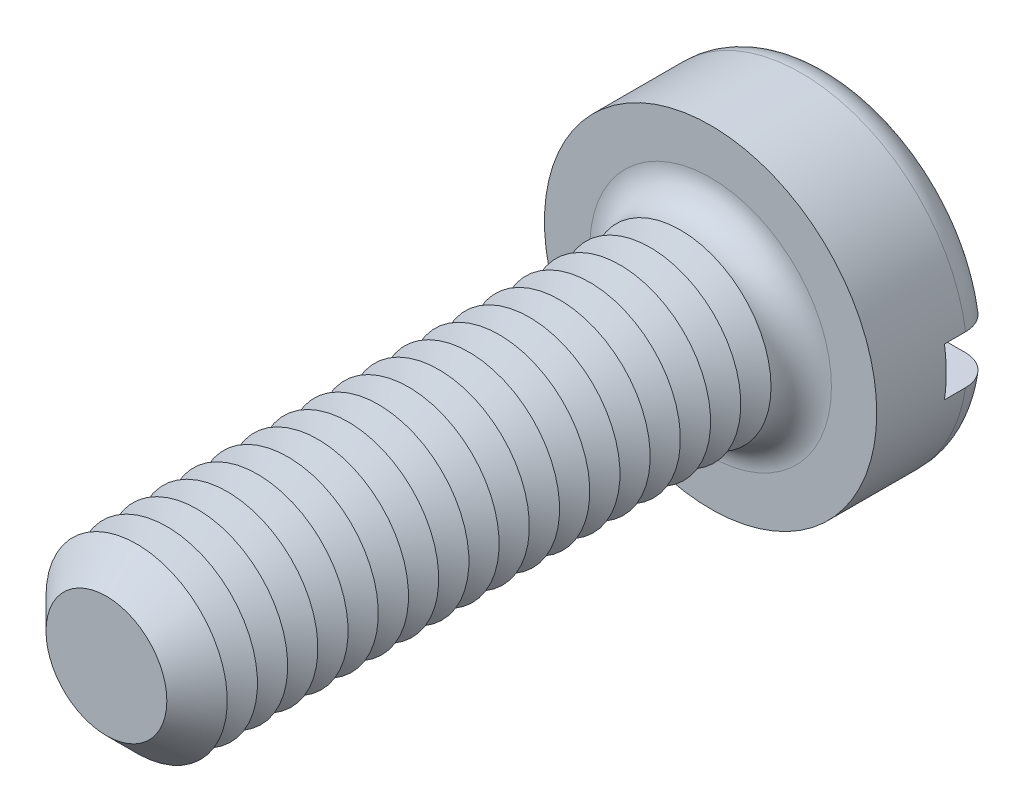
ISO-10303-21;
HEADER;
FILE_DESCRIPTION(('STEP AP214'),'2;1');
FILE_NAME('part.step','',(''),(''),'','','');
FILE_SCHEMA(('AUTOMOTIVE_DESIGN { 1 0 10303 214 1 1 1 1 }'));
ENDSEC;
DATA;
#1=APPLICATION_CONTEXT('core data for automotive mechanical design processes');
#2=APPLICATION_PROTOCOL_DEFINITION('international standard','automotive_design',2000,#1);
#3=PRODUCT_CONTEXT('',#1,'mechanical');
#4=PRODUCT('Part','Part','',(#3));
#5=PRODUCT_RELATED_PRODUCT_CATEGORY('part','',(#4));
#6=PRODUCT_DEFINITION_FORMATION('','',#4);
#7=PRODUCT_DEFINITION_CONTEXT('part definition',#1,'design');
#8=PRODUCT_DEFINITION('design','',#6,#7);
#9=PRODUCT_DEFINITION_SHAPE('','',#8);
#10=(LENGTH_UNIT() NAMED_UNIT(*) SI_UNIT(.MILLI.,.METRE.));
#11=(NAMED_UNIT(*) PLANE_ANGLE_UNIT() SI_UNIT($,.RADIAN.));
#12=(NAMED_UNIT(*) SI_UNIT($,.STERADIAN.) SOLID_ANGLE_UNIT());
#13=UNCERTAINTY_MEASURE_WITH_UNIT(LENGTH_MEASURE(1.E-05),#10,'distance_accuracy_value','');
#14=(GEOMETRIC_REPRESENTATION_CONTEXT(3) GLOBAL_UNCERTAINTY_ASSIGNED_CONTEXT((#13)) GLOBAL_UNIT_ASSIGNED_CONTEXT((#10,
#11,#12)) REPRESENTATION_CONTEXT('',''));
#15=CARTESIAN_POINT('',(0.,0.,0.));
#16=DIRECTION('',(0.,0.,1.));
#17=DIRECTION('',(1.,0.,0.));
#18=AXIS2_PLACEMENT_3D('',#15,#16,#17);
#19=CARTESIAN_POINT('',(0.,0.,-2.));
#20=DIRECTION('',(0.,0.,1.));
#21=DIRECTION('',(1.,0.,0.));
#22=AXIS2_PLACEMENT_3D('',#19,#20,#21);
#23=PLANE('',#22);
#24=CARTESIAN_POINT('',(0.,0.,-2.));
#25=DIRECTION('',(0.,0.,1.));
#26=DIRECTION('',(1.,0.,0.));
#27=AXIS2_PLACEMENT_3D('',#24,#25,#26);
#28=CIRCLE('',#27,2.25);
#29=CARTESIAN_POINT('',(-2.21415898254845,0.4,-2.));
#30=VERTEX_POINT('',#29);
#31=CARTESIAN_POINT('',(2.21415898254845,0.4,-2.));
#32=VERTEX_POINT('',#31);
#33=EDGE_CURVE('E116',#30,#32,#28,.F.);
#34=ORIENTED_EDGE('',*,*,#33,.T.);
#35=DIRECTION('',(1.,0.,0.));
#36=VECTOR('',#35,1.);
#37=CARTESIAN_POINT('',(-2.75,0.400000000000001,-2.));
#38=LINE('',#37,#36);
#39=EDGE_CURVE('E111',#30,#32,#38,.T.);
#40=ORIENTED_EDGE('',*,*,#39,.F.);
#41=EDGE_LOOP('',(#34,#40));
#42=FACE_BOUND('',#41,.T.);
#43=ADVANCED_FACE('F39',(#42),#23,.F.);
#44=CARTESIAN_POINT('',(0.,0.,-1.5));
#45=DIRECTION('',(0.,0.,1.));
#46=DIRECTION('',(1.,0.,0.));
#47=AXIS2_PLACEMENT_3D('',#44,#45,#46);
#48=TOROIDAL_SURFACE('',#47,2.25,0.5);
#49=CARTESIAN_POINT('',(-2.6296588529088,0.400000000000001,-1.78631483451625));
#50=CARTESIAN_POINT('',(-2.61332846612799,0.400000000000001,-1.80942627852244));
#51=CARTESIAN_POINT('',(-2.59501593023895,0.400000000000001,-1.83116426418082));
#52=CARTESIAN_POINT('',(-2.55497423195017,0.400000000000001,-1.87126271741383));
#53=CARTESIAN_POINT('',(-2.53324055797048,0.4,-1.88961865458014));
#54=CARTESIAN_POINT('',(-2.48702796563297,0.4,-1.92241505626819));
#55=CARTESIAN_POINT('',(-2.46255183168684,0.4,-1.93685944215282));
#56=CARTESIAN_POINT('',(-2.41154731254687,0.4,-1.96147315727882));
#57=CARTESIAN_POINT('',(-2.38501943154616,0.4,-1.97164353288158));
#58=CARTESIAN_POINT('',(-2.3303912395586,0.4,-1.98753780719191));
#59=CARTESIAN_POINT('',(-2.30227842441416,0.4,-1.99321871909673));
#60=CARTESIAN_POINT('',(-2.24549884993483,0.4,-1.99984170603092));
#61=CARTESIAN_POINT('',(-2.21683202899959,0.4,-2.00078325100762));
#62=CARTESIAN_POINT('',(-2.15939326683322,0.4,-1.99790249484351));
#63=CARTESIAN_POINT('',(-2.13062419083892,0.4,-1.99402290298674));
#64=CARTESIAN_POINT('',(-2.07413526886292,0.4,-1.98151915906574));
#65=CARTESIAN_POINT('',(-2.04641547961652,0.4,-1.97289475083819));
#66=CARTESIAN_POINT('',(-1.99264697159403,0.4,-1.95107177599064));
#67=CARTESIAN_POINT('',(-1.96660904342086,0.4,-1.93784659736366));
#68=CARTESIAN_POINT('',(-1.91713954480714,0.4,-1.90718730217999));
#69=CARTESIAN_POINT('',(-1.89370795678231,0.4,-1.88975321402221));
#70=CARTESIAN_POINT('',(-1.85029144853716,0.4,-1.85126548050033));
#71=CARTESIAN_POINT('',(-1.83028607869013,0.4,-1.83023492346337));
#72=CARTESIAN_POINT('',(-1.79417432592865,0.4,-1.78505552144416));
#73=CARTESIAN_POINT('',(-1.77806752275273,0.4,-1.76090701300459));
#74=CARTESIAN_POINT('',(-1.75056079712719,0.4,-1.71067721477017));
#75=CARTESIAN_POINT('',(-1.7390748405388,0.4,-1.68464306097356));
#76=CARTESIAN_POINT('',(-1.72075680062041,0.4,-1.63098625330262));
#77=CARTESIAN_POINT('',(-1.71392397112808,0.4,-1.60336385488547));
#78=CARTESIAN_POINT('',(-1.70525661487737,0.4,-1.54801066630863));
#79=CARTESIAN_POINT('',(-1.70330866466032,0.4,-1.52029759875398));
#80=CARTESIAN_POINT('',(-1.70414820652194,0.4,-1.46494458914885));
#81=CARTESIAN_POINT('',(-1.70693532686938,0.4,-1.43730464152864));
#82=CARTESIAN_POINT('',(-1.71709335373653,0.4,-1.38318389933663));
#83=CARTESIAN_POINT('',(-1.72441580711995,0.4,-1.35669397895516));
#84=CARTESIAN_POINT('',(-1.74335830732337,0.4,-1.30529964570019));
#85=CARTESIAN_POINT('',(-1.75497853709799,0.4,-1.2803953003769));
#86=CARTESIAN_POINT('',(-1.78229453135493,0.4,-1.23258298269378));
#87=CARTESIAN_POINT('',(-1.79803217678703,0.4,-1.20969896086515));
#88=CARTESIAN_POINT('',(-1.83304498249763,0.4,-1.16682064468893));
#89=CARTESIAN_POINT('',(-1.85232054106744,0.4,-1.1468266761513));
#90=CARTESIAN_POINT('',(-1.89433695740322,0.4,-1.10980713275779));
#91=CARTESIAN_POINT('',(-1.91714740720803,0.4,-1.09286053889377));
#92=CARTESIAN_POINT('',(-1.96524407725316,0.4,-1.06294809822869));
#93=CARTESIAN_POINT('',(-1.99053056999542,0.4,-1.04998269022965));
#94=CARTESIAN_POINT('',(-2.04340612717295,0.4,-1.02814800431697));
#95=CARTESIAN_POINT('',(-2.07103098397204,0.4,-1.01936532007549));
#96=CARTESIAN_POINT('',(-2.12735840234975,0.4,-1.00652373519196));
#97=CARTESIAN_POINT('',(-2.15606102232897,0.4,-1.00246509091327));
#98=CARTESIAN_POINT('',(-2.21395379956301,0.4,-0.999181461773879));
#99=CARTESIAN_POINT('',(-2.24314598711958,0.4,-0.999992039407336));
#100=CARTESIAN_POINT('',(-2.30097585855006,0.4,-1.00652779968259));
#101=CARTESIAN_POINT('',(-2.32961355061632,0.4,-1.01225290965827));
#102=CARTESIAN_POINT('',(-2.38536238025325,0.4,-1.02843951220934));
#103=CARTESIAN_POINT('',(-2.41248047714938,0.4,-1.03887701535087));
#104=CARTESIAN_POINT('',(-2.46454860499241,0.4,-1.06421009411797));
#105=CARTESIAN_POINT('',(-2.48949875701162,0.4,-1.0791054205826));
#106=CARTESIAN_POINT('',(-2.53620471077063,0.4,-1.11274531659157));
#107=CARTESIAN_POINT('',(-2.55799482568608,0.400000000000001,-1.1314422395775));
#108=CARTESIAN_POINT('',(-2.59807595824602,0.400000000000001,-1.17227176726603));
#109=CARTESIAN_POINT('',(-2.6163672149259,0.400000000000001,-1.19440413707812));
#110=CARTESIAN_POINT('',(-2.64868581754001,0.400000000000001,-1.24117072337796));
#111=CARTESIAN_POINT('',(-2.66276466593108,0.400000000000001,-1.26576935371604));
#112=CARTESIAN_POINT('',(-2.68654482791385,0.400000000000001,-1.31699754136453));
#113=CARTESIAN_POINT('',(-2.69624657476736,0.400000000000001,-1.34362689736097));
#114=CARTESIAN_POINT('',(-2.71090527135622,0.400000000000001,-1.39787706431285));
#115=CARTESIAN_POINT('',(-2.71590826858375,0.400000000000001,-1.4254854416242));
#116=CARTESIAN_POINT('',(-2.72118463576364,0.400000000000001,-1.48115803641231));
#117=CARTESIAN_POINT('',(-2.72145696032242,0.400000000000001,-1.50922235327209));
#118=CARTESIAN_POINT('',(-2.71727180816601,0.400000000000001,-1.56487271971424));
#119=CARTESIAN_POINT('',(-2.71283440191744,0.400000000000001,-1.59246029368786));
#120=CARTESIAN_POINT('',(-2.69939521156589,0.400000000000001,-1.64647499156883));
#121=CARTESIAN_POINT('',(-2.69039909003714,0.400000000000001,-1.67290351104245));
#122=CARTESIAN_POINT('',(-2.67251693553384,0.400000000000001,-1.71382731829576));
#123=CARTESIAN_POINT('',(-2.66497994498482,0.400000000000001,-1.72892686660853));
#124=CARTESIAN_POINT('',(-2.64841616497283,0.400000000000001,-1.75828509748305));
#125=CARTESIAN_POINT('',(-2.63938938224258,0.400000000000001,-1.77254378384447));
#126=CARTESIAN_POINT('',(-2.6296588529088,0.400000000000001,-1.78631483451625));
#127=B_SPLINE_CURVE_WITH_KNOTS('',3,(#49,#50,#51,#52,#53,#54,#55,#56,#57,#58,#59,#60,#61,#62,
#63,#64,#65,#66,#67,#68,#69,#70,#71,#72,#73,#74,#75,#76,#77,#78,#79,#80,#81,#82,#83,#84,#85,#86,
#87,#88,#89,#90,#91,#92,#93,#94,#95,#96,#97,#98,#99,#100,#101,#102,#103,#104,#105,#106,#107,
#108,#109,#110,#111,#112,#113,#114,#115,#116,#117,#118,#119,#120,#121,#122,#123,#124,#125,#126),
.UNSPECIFIED.,.T.,.F.,(4,2,2,2,2,2,2,2,2,2,2,2,2,2,2,2,2,2,2,2,2,2,2,2,2,2,2,2,2,2,2,2,2,2,2,2,
2,2,4),(0.,0.0848338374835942,0.16978050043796,0.254641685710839,0.339482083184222,
0.42512530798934,0.510778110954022,0.597458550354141,0.684143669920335,0.771338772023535,
0.858533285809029,0.945187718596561,1.03183280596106,1.11678035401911,1.20171427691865,
1.28465703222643,1.36759327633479,1.4496584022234,1.53172702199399,1.61466526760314,
1.69761285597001,1.78247103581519,1.86733856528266,1.95389396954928,2.0404540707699,
2.12764713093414,2.21483890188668,2.30159172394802,2.38833969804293,2.4740609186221,
2.55977628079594,2.6443962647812,2.72900787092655,2.81278135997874,2.89657336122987,
2.98000971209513,3.06334267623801,3.113891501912,3.16444009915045),.UNSPECIFIED.);
#128=CARTESIAN_POINT('',(-2.72075357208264,0.400000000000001,-1.50000000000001));
#129=VERTEX_POINT('',#128);
#130=EDGE_CURVE('E323',#129,#30,#127,.T.);
#131=ORIENTED_EDGE('',*,*,#130,.F.);
#132=CARTESIAN_POINT('',(0.,0.,-1.5));
#133=DIRECTION('',(0.,0.,1.));
#134=DIRECTION('',(1.,0.,0.));
#135=AXIS2_PLACEMENT_3D('',#132,#133,#134);
#136=CIRCLE('',#135,2.75);
#137=CARTESIAN_POINT('',(2.7207535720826,0.4,-1.5));
#138=VERTEX_POINT('',#137);
#139=EDGE_CURVE('E125',#138,#129,#136,.T.);
#140=ORIENTED_EDGE('',*,*,#139,.F.);
#141=CARTESIAN_POINT('',(1.7362507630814,0.4,-1.6752840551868));
#142=CARTESIAN_POINT('',(1.74636083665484,0.4,-1.70159961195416));
#143=CARTESIAN_POINT('',(1.7587429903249,0.4,-1.72706707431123));
#144=CARTESIAN_POINT('',(1.78764414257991,0.4,-1.77556609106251));
#145=CARTESIAN_POINT('',(1.80416918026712,0.4,-1.79859401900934));
#146=CARTESIAN_POINT('',(1.84080454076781,0.4,-1.84153587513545));
#147=CARTESIAN_POINT('',(1.86090949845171,0.4,-1.86145438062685));
#148=CARTESIAN_POINT('',(1.9041208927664,0.4,-1.89769607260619));
#149=CARTESIAN_POINT('',(1.92722659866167,0.4,-1.91402013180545));
#150=CARTESIAN_POINT('',(1.97620958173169,0.4,-1.94291288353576));
#151=CARTESIAN_POINT('',(2.00212726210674,0.4,-1.95541309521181));
#152=CARTESIAN_POINT('',(2.05567603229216,0.4,-1.97595143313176));
#153=CARTESIAN_POINT('',(2.08330733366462,0.4,-1.98398900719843));
#154=CARTESIAN_POINT('',(2.13989163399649,0.4,-1.99545904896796));
#155=CARTESIAN_POINT('',(2.16885726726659,0.4,-1.99882930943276));
#156=CARTESIAN_POINT('',(2.22694412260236,0.4,-2.00065872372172));
#157=CARTESIAN_POINT('',(2.25606534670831,0.4,-1.99911781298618));
#158=CARTESIAN_POINT('',(2.31362436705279,0.4,-1.99114818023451));
#159=CARTESIAN_POINT('',(2.34206235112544,0.4,-1.98472081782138));
#160=CARTESIAN_POINT('',(2.39743709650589,0.4,-1.96713601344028));
#161=CARTESIAN_POINT('',(2.42437392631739,0.4,-1.95597878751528));
#162=CARTESIAN_POINT('',(2.47569769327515,0.4,-1.92935960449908));
#163=CARTESIAN_POINT('',(2.50010686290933,0.4,-1.91394052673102));
#164=CARTESIAN_POINT('',(2.54594525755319,0.4,-1.8791725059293));
#165=CARTESIAN_POINT('',(2.56737468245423,0.4,-1.85982382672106));
#166=CARTESIAN_POINT('',(2.60634898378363,0.4,-1.81801641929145));
#167=CARTESIAN_POINT('',(2.6239407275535,0.4,-1.79560138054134));
#168=CARTESIAN_POINT('',(2.65505953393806,0.4,-1.7481077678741));
#169=CARTESIAN_POINT('',(2.66858686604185,0.4,-1.72302937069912));
#170=CARTESIAN_POINT('',(2.69103536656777,0.4,-1.67123055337));
#171=CARTESIAN_POINT('',(2.70000740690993,0.4,-1.64453217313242));
#172=CARTESIAN_POINT('',(2.71330608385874,0.4,-1.59000262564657));
#173=CARTESIAN_POINT('',(2.71763293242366,0.4,-1.5621715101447));
#174=CARTESIAN_POINT('',(2.72149675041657,0.4,-1.50637655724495));
#175=CARTESIAN_POINT('',(2.72106725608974,0.4,-1.47841503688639));
#176=CARTESIAN_POINT('',(2.7155123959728,0.4,-1.42296287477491));
#177=CARTESIAN_POINT('',(2.71038711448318,0.4,-1.39547222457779));
#178=CARTESIAN_POINT('',(2.69560462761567,0.4,-1.34178071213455));
#179=CARTESIAN_POINT('',(2.68595389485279,0.4,-1.31557806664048));
#180=CARTESIAN_POINT('',(2.66240876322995,0.4,-1.26515516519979));
#181=CARTESIAN_POINT('',(2.64851431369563,0.4,-1.24093493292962));
#182=CARTESIAN_POINT('',(2.61681930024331,0.4,-1.19504594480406));
#183=CARTESIAN_POINT('',(2.59900198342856,0.4,-1.17338876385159));
#184=CARTESIAN_POINT('',(2.56001495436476,0.4,-1.13333899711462));
#185=CARTESIAN_POINT('',(2.53884510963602,0.4,-1.11494654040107));
#186=CARTESIAN_POINT('',(2.49354554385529,0.4,-1.08175888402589));
#187=CARTESIAN_POINT('',(2.46938991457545,0.4,-1.06699905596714));
#188=CARTESIAN_POINT('',(2.41896725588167,0.4,-1.04168682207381));
#189=CARTESIAN_POINT('',(2.39270009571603,0.4,-1.03113467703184));
#190=CARTESIAN_POINT('',(2.33844927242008,0.4,-1.01439607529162));
#191=CARTESIAN_POINT('',(2.31044823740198,0.4,-1.00826592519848));
#192=CARTESIAN_POINT('',(2.25381752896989,0.4,-1.00073183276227));
#193=CARTESIAN_POINT('',(2.22518781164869,0.4,-0.999328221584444));
#194=CARTESIAN_POINT('',(2.16774231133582,0.4,-1.00127811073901));
#195=CARTESIAN_POINT('',(2.13892848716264,0.4,-1.00468955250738));
#196=CARTESIAN_POINT('',(2.08227193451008,0.4,-1.01626887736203));
#197=CARTESIAN_POINT('',(2.05442926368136,0.4,-1.02443704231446));
#198=CARTESIAN_POINT('',(2.00032604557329,0.4,-1.04537295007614));
#199=CARTESIAN_POINT('',(1.97407661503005,0.4,-1.05816944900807));
#200=CARTESIAN_POINT('',(1.92411255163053,0.4,-1.08801035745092));
#201=CARTESIAN_POINT('',(1.90039792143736,0.4,-1.10505477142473));
#202=CARTESIAN_POINT('',(1.85633574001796,0.4,-1.14282887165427));
#203=CARTESIAN_POINT('',(1.83597040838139,0.4,-1.16353779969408));
#204=CARTESIAN_POINT('',(1.79908731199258,0.4,-1.20813793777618));
#205=CARTESIAN_POINT('',(1.78256899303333,0.4,-1.23202868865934));
#206=CARTESIAN_POINT('',(1.75420022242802,0.4,-1.28183173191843));
#207=CARTESIAN_POINT('',(1.74226635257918,0.4,-1.30769648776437));
#208=CARTESIAN_POINT('',(1.72302798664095,0.4,-1.36110211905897));
#209=CARTESIAN_POINT('',(1.71572395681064,0.4,-1.38864316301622));
#210=CARTESIAN_POINT('',(1.70611974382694,0.4,-1.44392326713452));
#211=CARTESIAN_POINT('',(1.70370764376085,0.4,-1.47164298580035));
#212=CARTESIAN_POINT('',(1.70363822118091,0.4,-1.52706336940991));
#213=CARTESIAN_POINT('',(1.70597448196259,0.4,-1.55476400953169));
#214=CARTESIAN_POINT('',(1.71335146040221,0.4,-1.59796127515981));
#215=CARTESIAN_POINT('',(1.71686033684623,0.4,-1.61373520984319));
#216=CARTESIAN_POINT('',(1.7254146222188,0.4,-1.64486018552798));
#217=CARTESIAN_POINT('',(1.73045999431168,0.4,-1.66021123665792));
#218=CARTESIAN_POINT('',(1.7362507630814,0.4,-1.6752840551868));
#219=B_SPLINE_CURVE_WITH_KNOTS('',3,(#141,#142,#143,#144,#145,#146,#147,#148,#149,#150,#151,
#152,#153,#154,#155,#156,#157,#158,#159,#160,#161,#162,#163,#164,#165,#166,#167,#168,#169,#170,
#171,#172,#173,#174,#175,#176,#177,#178,#179,#180,#181,#182,#183,#184,#185,#186,#187,#188,#189,
#190,#191,#192,#193,#194,#195,#196,#197,#198,#199,#200,#201,#202,#203,#204,#205,#206,#207,#208,
#209,#210,#211,#212,#213,#214,#215,#216,#217,#218),.UNSPECIFIED.,.T.,.F.,(4,2,2,2,2,2,2,2,2,2,2,
2,2,2,2,2,2,2,2,2,2,2,2,2,2,2,2,2,2,2,2,2,2,2,2,2,2,2,4),(0.,0.0845117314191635,
0.169147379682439,0.253657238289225,0.338146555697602,0.424070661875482,0.510005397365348,
0.597074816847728,0.684145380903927,0.771191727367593,0.858234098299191,0.94443074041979,
1.03062159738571,1.11569223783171,1.20075723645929,1.28485012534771,1.36893917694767,
1.45243570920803,1.53593074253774,1.61930671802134,1.70268368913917,1.7864238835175,
1.87016738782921,1.95469664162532,2.03923113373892,2.12482389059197,2.21042264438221,
2.29706026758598,2.38370302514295,2.47089361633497,2.55808429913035,2.64479602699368,
2.73149525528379,2.81653234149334,2.9015779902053,2.98465497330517,3.06761976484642,
3.11602689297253,3.164432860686),.UNSPECIFIED.);
#220=EDGE_CURVE('E325',#32,#138,#219,.T.);
#221=ORIENTED_EDGE('',*,*,#220,.F.);
#222=ORIENTED_EDGE('',*,*,#33,.F.);
#223=EDGE_LOOP('',(#131,#140,#221,#222));
#224=FACE_BOUND('',#223,.T.);
#225=ADVANCED_FACE('F307',(#224),#48,.T.);
#226=CARTESIAN_POINT('',(0.,0.,-2.));
#227=DIRECTION('',(0.,0.,1.));
#228=DIRECTION('',(1.,0.,0.));
#229=AXIS2_PLACEMENT_3D('',#226,#227,#228);
#230=CYLINDRICAL_SURFACE('',#229,2.75);
#231=DIRECTION('',(0.,0.,1.));
#232=VECTOR('',#231,1.);
#233=CARTESIAN_POINT('',(2.72075357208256,0.4,-2.));
#234=LINE('',#233,#232);
#235=CARTESIAN_POINT('',(2.72075357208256,0.4,-1.15));
#236=VERTEX_POINT('',#235);
#237=EDGE_CURVE('E339',#138,#236,#234,.T.);
#238=ORIENTED_EDGE('',*,*,#237,.F.);
#239=ORIENTED_EDGE('',*,*,#139,.T.);
#240=DIRECTION('',(0.,0.,1.));
#241=VECTOR('',#240,1.);
#242=CARTESIAN_POINT('',(-2.72075357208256,0.4,-2.));
#243=LINE('',#242,#241);
#244=CARTESIAN_POINT('',(-2.72075357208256,0.4,-1.15));
#245=VERTEX_POINT('',#244);
#246=EDGE_CURVE('E63',#245,#129,#243,.F.);
#247=ORIENTED_EDGE('',*,*,#246,.F.);
#248=CARTESIAN_POINT('',(0.,0.,-1.15));
#249=DIRECTION('',(0.,0.,-1.));
#250=DIRECTION('',(-1.,0.,0.));
#251=AXIS2_PLACEMENT_3D('',#248,#249,#250);
#252=CIRCLE('',#251,2.75);
#253=CARTESIAN_POINT('',(-2.72075357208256,-0.4,-1.15));
#254=VERTEX_POINT('',#253);
#255=EDGE_CURVE('E43',#245,#254,#252,.F.);
#256=ORIENTED_EDGE('',*,*,#255,.T.);
#257=DIRECTION('',(0.,0.,1.));
#258=VECTOR('',#257,1.);
#259=CARTESIAN_POINT('',(-2.72075357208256,-0.4,-2.));
#260=LINE('',#259,#258);
#261=CARTESIAN_POINT('',(-2.72075357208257,-0.4,-1.5));
#262=VERTEX_POINT('',#261);
#263=EDGE_CURVE('E336',#262,#254,#260,.T.);
#264=ORIENTED_EDGE('',*,*,#263,.F.);
#265=CARTESIAN_POINT('',(2.72075357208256,-0.4,-1.5));
#266=VERTEX_POINT('',#265);
#267=EDGE_CURVE('E127',#262,#266,#136,.T.);
#268=ORIENTED_EDGE('',*,*,#267,.T.);
#269=DIRECTION('',(0.,0.,1.));
#270=VECTOR('',#269,1.);
#271=CARTESIAN_POINT('',(2.72075357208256,-0.4,-2.));
#272=LINE('',#271,#270);
#273=CARTESIAN_POINT('',(2.72075357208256,-0.4,-1.15));
#274=VERTEX_POINT('',#273);
#275=EDGE_CURVE('E55',#274,#266,#272,.F.);
#276=ORIENTED_EDGE('',*,*,#275,.F.);
#277=EDGE_CURVE('E11',#274,#236,#252,.F.);
#278=ORIENTED_EDGE('',*,*,#277,.T.);
#279=EDGE_LOOP('',(#238,#239,#247,#256,#264,#268,#276,#278));
#280=FACE_BOUND('',#279,.T.);
#281=CARTESIAN_POINT('',(0.,0.,0.));
#282=DIRECTION('',(0.,0.,1.));
#283=DIRECTION('',(1.,0.,0.));
#284=AXIS2_PLACEMENT_3D('',#281,#282,#283);
#285=CIRCLE('',#284,2.75);
#286=CARTESIAN_POINT('',(2.75,0.,0.));
#287=VERTEX_POINT('',#286);
#288=EDGE_CURVE('E342',#287,#287,#285,.T.);
#289=ORIENTED_EDGE('',*,*,#288,.F.);
#290=EDGE_LOOP('',(#289));
#291=FACE_BOUND('',#290,.T.);
#292=ADVANCED_FACE('F303',(#280,#291),#230,.T.);
#293=CARTESIAN_POINT('',(2.21415898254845,-0.4,-2.));
#294=VERTEX_POINT('',#293);
#295=CARTESIAN_POINT('',(-2.21415898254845,-0.4,-2.));
#296=VERTEX_POINT('',#295);
#297=EDGE_CURVE('E109',#294,#296,#28,.F.);
#298=ORIENTED_EDGE('',*,*,#297,.T.);
#299=DIRECTION('',(-1.,0.,0.));
#300=VECTOR('',#299,1.);
#301=CARTESIAN_POINT('',(-2.75,-0.4,-2.));
#302=LINE('',#301,#300);
#303=EDGE_CURVE('E96',#294,#296,#302,.T.);
#304=ORIENTED_EDGE('',*,*,#303,.F.);
#305=EDGE_LOOP('',(#298,#304));
#306=FACE_BOUND('',#305,.T.);
#307=ADVANCED_FACE('F108',(#306),#23,.F.);
#308=CARTESIAN_POINT('',(0.,0.,0.));
#309=DIRECTION('',(0.,0.,1.));
#310=DIRECTION('',(1.,0.,0.));
#311=AXIS2_PLACEMENT_3D('',#308,#309,#310);
#312=PLANE('',#311);
#313=CARTESIAN_POINT('',(0.,0.,0.));
#314=DIRECTION('',(0.,0.,1.));
#315=DIRECTION('',(1.,0.,0.));
#316=AXIS2_PLACEMENT_3D('',#313,#314,#315);
#317=CIRCLE('',#316,2.);
#318=CARTESIAN_POINT('',(2.,0.,0.));
#319=VERTEX_POINT('',#318);
#320=EDGE_CURVE('E115',#319,#319,#317,.F.);
#321=ORIENTED_EDGE('',*,*,#320,.T.);
#322=EDGE_LOOP('',(#321));
#323=FACE_BOUND('',#322,.T.);
#324=ORIENTED_EDGE('',*,*,#288,.T.);
#325=EDGE_LOOP('',(#324));
#326=FACE_BOUND('',#325,.T.);
#327=ADVANCED_FACE('F302',(#323,#326),#312,.T.);
#328=CARTESIAN_POINT('',(-2.6296588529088,-0.4,-1.78631483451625));
#329=CARTESIAN_POINT('',(-2.64575286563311,-0.4,-1.76353353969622));
#330=CARTESIAN_POINT('',(-2.65994473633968,-0.4,-1.73938506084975));
#331=CARTESIAN_POINT('',(-2.68408879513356,-0.4,-1.68903091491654));
#332=CARTESIAN_POINT('',(-2.69403633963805,-0.4,-1.6628230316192));
#333=CARTESIAN_POINT('',(-2.70937899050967,-0.4,-1.60911025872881));
#334=CARTESIAN_POINT('',(-2.71477511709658,-0.4,-1.5816056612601));
#335=CARTESIAN_POINT('',(-2.72085365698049,-0.4,-1.52608718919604));
#336=CARTESIAN_POINT('',(-2.7215371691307,-0.4,-1.49807343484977));
#337=CARTESIAN_POINT('',(-2.71817903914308,-0.4,-1.44242333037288));
#338=CARTESIAN_POINT('',(-2.71415291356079,-0.4,-1.41478604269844));
#339=CARTESIAN_POINT('',(-2.70152104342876,-0.4,-1.36057835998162));
#340=CARTESIAN_POINT('',(-2.69291517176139,-0.4,-1.33400799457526));
#341=CARTESIAN_POINT('',(-2.67137052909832,-0.4,-1.28266198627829));
#342=CARTESIAN_POINT('',(-2.65842829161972,-0.4,-1.25788779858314));
#343=CARTESIAN_POINT('',(-2.62859348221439,-0.4,-1.21084577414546));
#344=CARTESIAN_POINT('',(-2.61170082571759,-0.4,-1.18857799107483));
#345=CARTESIAN_POINT('',(-2.5743351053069,-0.4,-1.1470221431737));
#346=CARTESIAN_POINT('',(-2.55383974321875,-0.4,-1.12775413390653));
#347=CARTESIAN_POINT('',(-2.5099353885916,-0.4,-1.09288845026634));
#348=CARTESIAN_POINT('',(-2.48652625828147,-0.4,-1.07729094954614));
#349=CARTESIAN_POINT('',(-2.43718903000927,-0.4,-1.0500239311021));
#350=CARTESIAN_POINT('',(-2.41123629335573,-0.4,-1.0383990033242));
#351=CARTESIAN_POINT('',(-2.35776417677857,-0.4,-1.01960886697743));
#352=CARTESIAN_POINT('',(-2.33024469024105,-0.4,-1.01244396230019));
#353=CARTESIAN_POINT('',(-2.27404134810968,-0.4,-1.00268156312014));
#354=CARTESIAN_POINT('',(-2.24534705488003,-0.4,-1.00014414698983));
#355=CARTESIAN_POINT('',(-2.18793513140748,-0.4,-0.999867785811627));
#356=CARTESIAN_POINT('',(-2.15921749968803,-0.4,-1.00212917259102));
#357=CARTESIAN_POINT('',(-2.10225052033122,-0.4,-1.01142552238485));
#358=CARTESIAN_POINT('',(-2.07400941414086,-0.4,-1.01851105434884));
#359=CARTESIAN_POINT('',(-2.01911044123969,-0.4,-1.03730994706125));
#360=CARTESIAN_POINT('',(-1.99245264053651,-0.4,-1.04902350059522));
#361=CARTESIAN_POINT('',(-1.94142108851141,-0.4,-1.07679847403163));
#362=CARTESIAN_POINT('',(-1.91705303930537,-0.4,-1.09287038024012));
#363=CARTESIAN_POINT('',(-1.87139758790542,-0.4,-1.12891897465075));
#364=CARTESIAN_POINT('',(-1.85011007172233,-0.4,-1.14889551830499));
#365=CARTESIAN_POINT('',(-1.81149058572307,-0.4,-1.19196940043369));
#366=CARTESIAN_POINT('',(-1.79411779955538,-0.4,-1.21503011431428));
#367=CARTESIAN_POINT('',(-1.76359546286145,-0.4,-1.26379588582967));
#368=CARTESIAN_POINT('',(-1.75044532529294,-0.4,-1.28950057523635));
#369=CARTESIAN_POINT('',(-1.72906221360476,-0.4,-1.3422057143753));
#370=CARTESIAN_POINT('',(-1.72072512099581,-0.4,-1.3691639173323));
#371=CARTESIAN_POINT('',(-1.70880448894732,-0.4,-1.42411084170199));
#372=CARTESIAN_POINT('',(-1.7052202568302,-0.4,-1.45209941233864));
#373=CARTESIAN_POINT('',(-1.70295553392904,-0.4,-1.50768522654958));
#374=CARTESIAN_POINT('',(-1.70417398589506,-0.4,-1.53527840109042));
#375=CARTESIAN_POINT('',(-1.71124536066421,-0.4,-1.58986292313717));
#376=CARTESIAN_POINT('',(-1.71709811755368,-0.4,-1.61685429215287));
#377=CARTESIAN_POINT('',(-1.73321132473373,-0.4,-1.66938107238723));
#378=CARTESIAN_POINT('',(-1.74345625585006,-0.4,-1.69492125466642));
#379=CARTESIAN_POINT('',(-1.76802111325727,-0.4,-1.74395877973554));
#380=CARTESIAN_POINT('',(-1.78234133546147,-0.4,-1.76745597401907));
#381=CARTESIAN_POINT('',(-1.81488631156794,-0.4,-1.81216193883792));
#382=CARTESIAN_POINT('',(-1.83317116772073,-0.4,-1.83332693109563));
#383=CARTESIAN_POINT('',(-1.87296030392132,-0.4,-1.872375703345));
#384=CARTESIAN_POINT('',(-1.89446497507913,-0.4,-1.89025908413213));
#385=CARTESIAN_POINT('',(-1.94063077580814,-0.4,-1.92267732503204));
#386=CARTESIAN_POINT('',(-1.96535444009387,-0.4,-1.93712316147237));
#387=CARTESIAN_POINT('',(-2.01684705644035,-0.4,-1.96173690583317));
#388=CARTESIAN_POINT('',(-2.04361620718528,-0.4,-1.97190439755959));
#389=CARTESIAN_POINT('',(-2.09891021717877,-0.4,-1.9878230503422));
#390=CARTESIAN_POINT('',(-2.12745653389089,-0.4,-1.99349978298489));
#391=CARTESIAN_POINT('',(-2.18509639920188,-0.4,-1.99999556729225));
#392=CARTESIAN_POINT('',(-2.21418994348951,-0.4,-2.00081465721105));
#393=CARTESIAN_POINT('',(-2.27218032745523,-0.4,-1.99755156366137));
#394=CARTESIAN_POINT('',(-2.30107643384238,-0.4,-1.99345627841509));
#395=CARTESIAN_POINT('',(-2.35776697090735,-0.4,-1.98043125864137));
#396=CARTESIAN_POINT('',(-2.38556116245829,-0.4,-1.97150048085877));
#397=CARTESIAN_POINT('',(-2.43901832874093,-0.4,-1.94912081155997));
#398=CARTESIAN_POINT('',(-2.46469578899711,-0.4,-1.93570648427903));
#399=CARTESIAN_POINT('',(-2.51337022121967,-0.4,-1.90471183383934));
#400=CARTESIAN_POINT('',(-2.53637056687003,-0.4,-1.88713684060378));
#401=CARTESIAN_POINT('',(-2.57111030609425,-0.4,-1.85552084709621));
#402=CARTESIAN_POINT('',(-2.58386709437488,-0.4,-1.84257896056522));
#403=CARTESIAN_POINT('',(-2.60790410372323,-0.4,-1.81538935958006));
#404=CARTESIAN_POINT('',(-2.61918433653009,-0.4,-1.80114165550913));
#405=CARTESIAN_POINT('',(-2.6296588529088,-0.4,-1.78631483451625));
#406=B_SPLINE_CURVE_WITH_KNOTS('',3,(#328,#329,#330,#331,#332,#333,#334,#335,#336,#337,#338,
#339,#340,#341,#342,#343,#344,#345,#346,#347,#348,#349,#350,#351,#352,#353,#354,#355,#356,#357,
#358,#359,#360,#361,#362,#363,#364,#365,#366,#367,#368,#369,#370,#371,#372,#373,#374,#375,#376,
#377,#378,#379,#380,#381,#382,#383,#384,#385,#386,#387,#388,#389,#390,#391,#392,#393,#394,#395,
#396,#397,#398,#399,#400,#401,#402,#403,#404,#405),.UNSPECIFIED.,.T.,.F.,(4,2,2,2,2,2,2,2,2,2,2,
2,2,2,2,2,2,2,2,2,2,2,2,2,2,2,2,2,2,2,2,2,2,2,2,2,2,2,4),(0.,0.0836125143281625,
0.167316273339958,0.251001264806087,0.334666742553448,0.418057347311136,0.501450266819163,
0.584910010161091,0.668371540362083,0.752369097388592,0.836370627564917,0.921286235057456,
1.00620762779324,1.09222390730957,1.17824613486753,1.26518425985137,1.35212600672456,
1.43927882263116,1.52642841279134,1.61262232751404,1.69880425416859,1.7830443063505,
1.86727208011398,1.9497371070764,2.03219918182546,2.1143722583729,2.19655130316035,
2.28007615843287,2.36361116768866,2.44911836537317,2.53463387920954,2.62153862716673,
2.70844269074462,2.79557895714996,2.88273403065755,2.96923214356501,3.05562004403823,
3.11003826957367,3.16445606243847),.UNSPECIFIED.);
#407=EDGE_CURVE('E103',#296,#262,#406,.T.);
#408=ORIENTED_EDGE('',*,*,#407,.F.);
#409=ORIENTED_EDGE('',*,*,#297,.F.);
#410=CARTESIAN_POINT('',(1.7362507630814,-0.4,-1.6752840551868));
#411=CARTESIAN_POINT('',(1.72641416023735,-0.4,-1.64967314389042));
#412=CARTESIAN_POINT('',(1.71871480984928,-0.4,-1.62322216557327));
#413=CARTESIAN_POINT('',(1.70786038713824,-0.4,-1.56938399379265));
#414=CARTESIAN_POINT('',(1.70470970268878,-0.4,-1.54199592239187));
#415=CARTESIAN_POINT('',(1.70306971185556,-0.4,-1.48708393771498));
#416=CARTESIAN_POINT('',(1.70457942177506,-0.4,-1.45956005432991));
#417=CARTESIAN_POINT('',(1.71220670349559,-0.4,-1.40516538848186));
#418=CARTESIAN_POINT('',(1.71832341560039,-0.4,-1.3782944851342));
#419=CARTESIAN_POINT('',(1.73494792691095,-0.4,-1.32598312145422));
#420=CARTESIAN_POINT('',(1.74545076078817,-0.4,-1.30054108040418));
#421=CARTESIAN_POINT('',(1.77051013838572,-0.4,-1.25173932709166));
#422=CARTESIAN_POINT('',(1.7850670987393,-0.4,-1.22837982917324));
#423=CARTESIAN_POINT('',(1.81806903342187,-0.4,-1.1839775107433));
#424=CARTESIAN_POINT('',(1.8365752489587,-0.4,-1.16298023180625));
#425=CARTESIAN_POINT('',(1.87677669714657,-0.4,-1.1243010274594));
#426=CARTESIAN_POINT('',(1.89847230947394,-0.4,-1.10661949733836));
#427=CARTESIAN_POINT('',(1.94498854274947,-0.4,-1.07463966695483));
#428=CARTESIAN_POINT('',(1.96987078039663,-0.4,-1.06043095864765));
#429=CARTESIAN_POINT('',(2.02163980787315,-0.4,-1.0363161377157));
#430=CARTESIAN_POINT('',(2.04852678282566,-0.4,-1.02641042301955));
#431=CARTESIAN_POINT('',(2.10400319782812,-0.4,-1.01104128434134));
#432=CARTESIAN_POINT('',(2.13261287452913,-0.4,-1.00565079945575));
#433=CARTESIAN_POINT('',(2.19033179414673,-0.4,-0.999735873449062));
#434=CARTESIAN_POINT('',(2.2194410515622,-0.4,-0.999211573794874));
#435=CARTESIAN_POINT('',(2.27740442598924,-0.4,-1.00306591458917));
#436=CARTESIAN_POINT('',(2.30625777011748,-0.4,-1.00745623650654));
#437=CARTESIAN_POINT('',(2.36280530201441,-0.4,-1.02105937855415));
#438=CARTESIAN_POINT('',(2.39049952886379,-0.4,-1.03027203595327));
#439=CARTESIAN_POINT('',(2.44369359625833,-0.4,-1.05318710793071));
#440=CARTESIAN_POINT('',(2.46920965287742,-0.4,-1.0668518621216));
#441=CARTESIAN_POINT('',(2.51754507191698,-0.4,-1.09832423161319));
#442=CARTESIAN_POINT('',(2.54036461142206,-0.4,-1.11613157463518));
#443=CARTESIAN_POINT('',(2.58234752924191,-0.4,-1.15513986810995));
#444=CARTESIAN_POINT('',(2.601553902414,-0.4,-1.1762945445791));
#445=CARTESIAN_POINT('',(2.63609001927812,-0.4,-1.22156192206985));
#446=CARTESIAN_POINT('',(2.65142002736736,-0.4,-1.24567442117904));
#447=CARTESIAN_POINT('',(2.67757733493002,-0.4,-1.29585881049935));
#448=CARTESIAN_POINT('',(2.68845668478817,-0.4,-1.32190357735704));
#449=CARTESIAN_POINT('',(2.7056478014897,-0.4,-1.375459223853));
#450=CARTESIAN_POINT('',(2.71195980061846,-0.4,-1.40297002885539));
#451=CARTESIAN_POINT('',(2.71979288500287,-0.4,-1.45843707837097));
#452=CARTESIAN_POINT('',(2.72135241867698,-0.4,-1.48638789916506));
#453=CARTESIAN_POINT('',(2.71974298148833,-0.4,-1.54215266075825));
#454=CARTESIAN_POINT('',(2.71657412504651,-0.4,-1.56996660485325));
#455=CARTESIAN_POINT('',(2.70561779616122,-0.4,-1.62459191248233));
#456=CARTESIAN_POINT('',(2.69784258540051,-0.4,-1.65140573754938));
#457=CARTESIAN_POINT('',(2.6779146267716,-0.4,-1.70335337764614));
#458=CARTESIAN_POINT('',(2.66576185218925,-0.4,-1.72848718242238));
#459=CARTESIAN_POINT('',(2.63739107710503,-0.4,-1.77645196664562));
#460=CARTESIAN_POINT('',(2.62116029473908,-0.4,-1.79927538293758));
#461=CARTESIAN_POINT('',(2.58512700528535,-0.4,-1.84190182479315));
#462=CARTESIAN_POINT('',(2.56532438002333,-0.4,-1.86170475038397));
#463=CARTESIAN_POINT('',(2.522535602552,-0.4,-1.89791219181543));
#464=CARTESIAN_POINT('',(2.49952399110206,-0.4,-1.91428661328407));
#465=CARTESIAN_POINT('',(2.45110500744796,-0.4,-1.94299324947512));
#466=CARTESIAN_POINT('',(2.4256974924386,-0.4,-1.95532522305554));
#467=CARTESIAN_POINT('',(2.37288090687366,-0.4,-1.97575769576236));
#468=CARTESIAN_POINT('',(2.34545135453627,-0.4,-1.98380524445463));
#469=CARTESIAN_POINT('',(2.28963821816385,-0.4,-1.99524443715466));
#470=CARTESIAN_POINT('',(2.26125456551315,-0.4,-1.99863574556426));
#471=CARTESIAN_POINT('',(2.20395671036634,-0.4,-2.00070487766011));
#472=CARTESIAN_POINT('',(2.17504033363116,-0.4,-1.99932265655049));
#473=CARTESIAN_POINT('',(2.11784130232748,-0.4,-1.9917648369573));
#474=CARTESIAN_POINT('',(2.08955866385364,-0.4,-1.98558911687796));
#475=CARTESIAN_POINT('',(2.03419451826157,-0.4,-1.96854979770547));
#476=CARTESIAN_POINT('',(2.00712437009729,-0.4,-1.95764925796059));
#477=CARTESIAN_POINT('',(1.95519572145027,-0.4,-1.93144413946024));
#478=CARTESIAN_POINT('',(1.93033780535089,-0.4,-1.91613840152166));
#479=CARTESIAN_POINT('',(1.88362525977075,-0.4,-1.88157419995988));
#480=CARTESIAN_POINT('',(1.86176428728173,-0.4,-1.86232430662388));
#481=CARTESIAN_POINT('',(1.82167218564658,-0.4,-1.82038600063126));
#482=CARTESIAN_POINT('',(1.803436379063,-0.4,-1.7977020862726));
#483=CARTESIAN_POINT('',(1.77700088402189,-0.4,-1.7582526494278));
#484=CARTESIAN_POINT('',(1.7675549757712,-0.4,-1.74230781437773));
#485=CARTESIAN_POINT('',(1.75049861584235,-0.4,-1.70946415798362));
#486=CARTESIAN_POINT('',(1.7428881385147,-0.4,-1.69256534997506));
#487=CARTESIAN_POINT('',(1.7362507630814,-0.4,-1.6752840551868));
#488=B_SPLINE_CURVE_WITH_KNOTS('',3,(#410,#411,#412,#413,#414,#415,#416,#417,#418,#419,#420,
#421,#422,#423,#424,#425,#426,#427,#428,#429,#430,#431,#432,#433,#434,#435,#436,#437,#438,#439,
#440,#441,#442,#443,#444,#445,#446,#447,#448,#449,#450,#451,#452,#453,#454,#455,#456,#457,#458,
#459,#460,#461,#462,#463,#464,#465,#466,#467,#468,#469,#470,#471,#472,#473,#474,#475,#476,#477,
#478,#479,#480,#481,#482,#483,#484,#485,#486,#487),.UNSPECIFIED.,.T.,.F.,(4,2,2,2,2,2,2,2,2,2,2,
2,2,2,2,2,2,2,2,2,2,2,2,2,2,2,2,2,2,2,2,2,2,2,2,2,2,2,4),(0.,0.0822382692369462,
0.164555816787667,0.246855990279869,0.329140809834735,0.411332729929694,0.493533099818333,
0.577115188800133,0.660707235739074,0.746270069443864,0.831840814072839,0.918768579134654,
1.00569887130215,1.09283622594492,1.17997064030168,1.26638632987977,1.35279634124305,
1.43810213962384,1.52340211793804,1.60767384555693,1.69194128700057,1.77552515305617,
1.85910699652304,1.94246734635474,2.02582820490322,2.10945367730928,2.19308191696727,
2.2774160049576,2.36175512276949,2.4471137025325,2.53247843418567,2.61892083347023,
2.70536542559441,2.79249842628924,2.87965437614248,2.96662291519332,3.05347850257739,
3.10897061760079,3.16446195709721),.UNSPECIFIED.);
#489=EDGE_CURVE('E92',#266,#294,#488,.T.);
#490=ORIENTED_EDGE('',*,*,#489,.F.);
#491=ORIENTED_EDGE('',*,*,#267,.F.);
#492=EDGE_LOOP('',(#408,#409,#490,#491));
#493=FACE_BOUND('',#492,.T.);
#494=ADVANCED_FACE('F113',(#493),#48,.T.);
#495=CARTESIAN_POINT('',(0.,0.,0.5));
#496=DIRECTION('',(0.,0.,1.));
#497=DIRECTION('',(1.,0.,0.));
#498=AXIS2_PLACEMENT_3D('',#495,#496,#497);
#499=TOROIDAL_SURFACE('',#498,2.,0.5);
#500=ORIENTED_EDGE('',*,*,#320,.F.);
#501=EDGE_LOOP('',(#500));
#502=FACE_BOUND('',#501,.T.);
#503=CARTESIAN_POINT('',(0.,0.,0.5));
#504=DIRECTION('',(0.,0.,-1.));
#505=DIRECTION('',(-1.,0.,0.));
#506=AXIS2_PLACEMENT_3D('',#503,#504,#505);
#507=CIRCLE('',#506,1.5);
#508=CARTESIAN_POINT('',(-1.5,0.,0.5));
#509=VERTEX_POINT('',#508);
#510=EDGE_CURVE('E348',#509,#509,#507,.T.);
#511=ORIENTED_EDGE('',*,*,#510,.T.);
#512=EDGE_LOOP('',(#511));
#513=FACE_BOUND('',#512,.T.);
#514=ADVANCED_FACE('F295',(#502,#513),#499,.F.);
#515=CARTESIAN_POINT('',(0.,0.,0.750000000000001));
#516=DIRECTION('',(0.,0.,-1.));
#517=DIRECTION('',(-1.,0.,0.));
#518=AXIS2_PLACEMENT_3D('',#515,#516,#517);
#519=CONICAL_SURFACE('',#518,1.06698729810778,1.0471975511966);
#520=ORIENTED_EDGE('',*,*,#510,.F.);
#521=EDGE_LOOP('',(#520));
#522=FACE_BOUND('',#521,.T.);
#523=CARTESIAN_POINT('',(0.,0.,0.750000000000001));
#524=DIRECTION('',(0.,0.,-1.));
#525=DIRECTION('',(-1.,0.,0.));
#526=AXIS2_PLACEMENT_3D('',#523,#524,#525);
#527=CIRCLE('',#526,1.06698729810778);
#528=CARTESIAN_POINT('',(-1.06698729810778,0.,0.750000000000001));
#529=VERTEX_POINT('',#528);
#530=EDGE_CURVE('E354',#529,#529,#527,.T.);
#531=ORIENTED_EDGE('',*,*,#530,.T.);
#532=EDGE_LOOP('',(#531));
#533=FACE_BOUND('',#532,.T.);
#534=ADVANCED_FACE('F291',(#522,#533),#519,.T.);
#535=CARTESIAN_POINT('',(0.,0.,1.));
#536=DIRECTION('',(0.,0.,1.));
#537=DIRECTION('',(1.,0.,0.));
#538=AXIS2_PLACEMENT_3D('',#535,#536,#537);
#539=CONICAL_SURFACE('',#538,1.5,1.0471975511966);
#540=ORIENTED_EDGE('',*,*,#530,.F.);
#541=EDGE_LOOP('',(#540));
#542=FACE_BOUND('',#541,.T.);
#543=CARTESIAN_POINT('',(0.,0.,1.));
#544=DIRECTION('',(0.,0.,-1.));
#545=DIRECTION('',(-1.,0.,0.));
#546=AXIS2_PLACEMENT_3D('',#543,#544,#545);
#547=CIRCLE('',#546,1.5);
#548=CARTESIAN_POINT('',(-1.5,0.,1.));
#549=VERTEX_POINT('',#548);
#550=EDGE_CURVE('E360',#549,#549,#547,.T.);
#551=ORIENTED_EDGE('',*,*,#550,.T.);
#552=EDGE_LOOP('',(#551));
#553=FACE_BOUND('',#552,.T.);
#554=ADVANCED_FACE('F287',(#542,#553),#539,.T.);
#555=CARTESIAN_POINT('',(0.,0.,1.25));
#556=DIRECTION('',(0.,0.,-1.));
#557=DIRECTION('',(-1.,0.,0.));
#558=AXIS2_PLACEMENT_3D('',#555,#556,#557);
#559=CONICAL_SURFACE('',#558,1.06698729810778,1.0471975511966);
#560=ORIENTED_EDGE('',*,*,#550,.F.);
#561=EDGE_LOOP('',(#560));
#562=FACE_BOUND('',#561,.T.);
#563=CARTESIAN_POINT('',(0.,0.,1.25));
#564=DIRECTION('',(0.,0.,-1.));
#565=DIRECTION('',(-1.,0.,0.));
#566=AXIS2_PLACEMENT_3D('',#563,#564,#565);
#567=CIRCLE('',#566,1.06698729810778);
#568=CARTESIAN_POINT('',(-1.06698729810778,0.,1.25));
#569=VERTEX_POINT('',#568);
#570=EDGE_CURVE('E364',#569,#569,#567,.T.);
#571=ORIENTED_EDGE('',*,*,#570,.T.);
#572=EDGE_LOOP('',(#571));
#573=FACE_BOUND('',#572,.T.);
#574=ADVANCED_FACE('F283',(#562,#573),#559,.T.);
#575=CARTESIAN_POINT('',(0.,0.,1.5));
#576=DIRECTION('',(0.,0.,1.));
#577=DIRECTION('',(1.,0.,0.));
#578=AXIS2_PLACEMENT_3D('',#575,#576,#577);
#579=CONICAL_SURFACE('',#578,1.5,1.0471975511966);
#580=ORIENTED_EDGE('',*,*,#570,.F.);
#581=EDGE_LOOP('',(#580));
#582=FACE_BOUND('',#581,.T.);
#583=CARTESIAN_POINT('',(0.,0.,1.5));
#584=DIRECTION('',(0.,0.,-1.));
#585=DIRECTION('',(-1.,0.,0.));
#586=AXIS2_PLACEMENT_3D('',#583,#584,#585);
#587=CIRCLE('',#586,1.5);
#588=CARTESIAN_POINT('',(-1.5,0.,1.5));
#589=VERTEX_POINT('',#588);
#590=EDGE_CURVE('E368',#589,#589,#587,.T.);
#591=ORIENTED_EDGE('',*,*,#590,.T.);
#592=EDGE_LOOP('',(#591));
#593=FACE_BOUND('',#592,.T.);
#594=ADVANCED_FACE('F279',(#582,#593),#579,.T.);
#595=CARTESIAN_POINT('',(0.,0.,1.75));
#596=DIRECTION('',(0.,0.,-1.));
#597=DIRECTION('',(-1.,0.,0.));
#598=AXIS2_PLACEMENT_3D('',#595,#596,#597);
#599=CONICAL_SURFACE('',#598,1.06698729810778,1.0471975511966);
#600=ORIENTED_EDGE('',*,*,#590,.F.);
#601=EDGE_LOOP('',(#600));
#602=FACE_BOUND('',#601,.T.);
#603=CARTESIAN_POINT('',(0.,0.,1.75));
#604=DIRECTION('',(0.,0.,-1.));
#605=DIRECTION('',(-1.,0.,0.));
#606=AXIS2_PLACEMENT_3D('',#603,#604,#605);
#607=CIRCLE('',#606,1.06698729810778);
#608=CARTESIAN_POINT('',(-1.06698729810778,0.,1.75));
#609=VERTEX_POINT('',#608);
#610=EDGE_CURVE('E372',#609,#609,#607,.T.);
#611=ORIENTED_EDGE('',*,*,#610,.T.);
#612=EDGE_LOOP('',(#611));
#613=FACE_BOUND('',#612,.T.);
#614=ADVANCED_FACE('F275',(#602,#613),#599,.T.);
#615=CARTESIAN_POINT('',(0.,0.,2.));
#616=DIRECTION('',(0.,0.,1.));
#617=DIRECTION('',(1.,0.,0.));
#618=AXIS2_PLACEMENT_3D('',#615,#616,#617);
#619=CONICAL_SURFACE('',#618,1.5,1.0471975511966);
#620=ORIENTED_EDGE('',*,*,#610,.F.);
#621=EDGE_LOOP('',(#620));
#622=FACE_BOUND('',#621,.T.);
#623=CARTESIAN_POINT('',(0.,0.,2.));
#624=DIRECTION('',(0.,0.,-1.));
#625=DIRECTION('',(-1.,0.,0.));
#626=AXIS2_PLACEMENT_3D('',#623,#624,#625);
#627=CIRCLE('',#626,1.5);
#628=CARTESIAN_POINT('',(-1.5,0.,2.));
#629=VERTEX_POINT('',#628);
#630=EDGE_CURVE('E376',#629,#629,#627,.T.);
#631=ORIENTED_EDGE('',*,*,#630,.T.);
#632=EDGE_LOOP('',(#631));
#633=FACE_BOUND('',#632,.T.);
#634=ADVANCED_FACE('F271',(#622,#633),#619,.T.);
#635=CARTESIAN_POINT('',(0.,0.,2.25));
#636=DIRECTION('',(0.,0.,-1.));
#637=DIRECTION('',(-1.,0.,0.));
#638=AXIS2_PLACEMENT_3D('',#635,#636,#637);
#639=CONICAL_SURFACE('',#638,1.06698729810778,1.0471975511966);
#640=ORIENTED_EDGE('',*,*,#630,.F.);
#641=EDGE_LOOP('',(#640));
#642=FACE_BOUND('',#641,.T.);
#643=CARTESIAN_POINT('',(0.,0.,2.25));
#644=DIRECTION('',(0.,0.,-1.));
#645=DIRECTION('',(-1.,0.,0.));
#646=AXIS2_PLACEMENT_3D('',#643,#644,#645);
#647=CIRCLE('',#646,1.06698729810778);
#648=CARTESIAN_POINT('',(-1.06698729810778,0.,2.25));
#649=VERTEX_POINT('',#648);
#650=EDGE_CURVE('E380',#649,#649,#647,.T.);
#651=ORIENTED_EDGE('',*,*,#650,.T.);
#652=EDGE_LOOP('',(#651));
#653=FACE_BOUND('',#652,.T.);
#654=ADVANCED_FACE('F267',(#642,#653),#639,.T.);
#655=CARTESIAN_POINT('',(0.,0.,2.5));
#656=DIRECTION('',(0.,0.,1.));
#657=DIRECTION('',(1.,0.,0.));
#658=AXIS2_PLACEMENT_3D('',#655,#656,#657);
#659=CONICAL_SURFACE('',#658,1.5,1.0471975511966);
#660=ORIENTED_EDGE('',*,*,#650,.F.);
#661=EDGE_LOOP('',(#660));
#662=FACE_BOUND('',#661,.T.);
#663=CARTESIAN_POINT('',(0.,0.,2.5));
#664=DIRECTION('',(0.,0.,-1.));
#665=DIRECTION('',(-1.,0.,0.));
#666=AXIS2_PLACEMENT_3D('',#663,#664,#665);
#667=CIRCLE('',#666,1.5);
#668=CARTESIAN_POINT('',(-1.5,0.,2.5));
#669=VERTEX_POINT('',#668);
#670=EDGE_CURVE('E384',#669,#669,#667,.T.);
#671=ORIENTED_EDGE('',*,*,#670,.T.);
#672=EDGE_LOOP('',(#671));
#673=FACE_BOUND('',#672,.T.);
#674=ADVANCED_FACE('F263',(#662,#673),#659,.T.);
#675=CARTESIAN_POINT('',(0.,0.,2.75));
#676=DIRECTION('',(0.,0.,-1.));
#677=DIRECTION('',(-1.,0.,0.));
#678=AXIS2_PLACEMENT_3D('',#675,#676,#677);
#679=CONICAL_SURFACE('',#678,1.06698729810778,1.0471975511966);
#680=ORIENTED_EDGE('',*,*,#670,.F.);
#681=EDGE_LOOP('',(#680));
#682=FACE_BOUND('',#681,.T.);
#683=CARTESIAN_POINT('',(0.,0.,2.75));
#684=DIRECTION('',(0.,0.,-1.));
#685=DIRECTION('',(-1.,0.,0.));
#686=AXIS2_PLACEMENT_3D('',#683,#684,#685);
#687=CIRCLE('',#686,1.06698729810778);
#688=CARTESIAN_POINT('',(-1.06698729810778,0.,2.75));
#689=VERTEX_POINT('',#688);
#690=EDGE_CURVE('E388',#689,#689,#687,.T.);
#691=ORIENTED_EDGE('',*,*,#690,.T.);
#692=EDGE_LOOP('',(#691));
#693=FACE_BOUND('',#692,.T.);
#694=ADVANCED_FACE('F259',(#682,#693),#679,.T.);
#695=CARTESIAN_POINT('',(0.,0.,3.));
#696=DIRECTION('',(0.,0.,1.));
#697=DIRECTION('',(1.,0.,0.));
#698=AXIS2_PLACEMENT_3D('',#695,#696,#697);
#699=CONICAL_SURFACE('',#698,1.5,1.0471975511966);
#700=ORIENTED_EDGE('',*,*,#690,.F.);
#701=EDGE_LOOP('',(#700));
#702=FACE_BOUND('',#701,.T.);
#703=CARTESIAN_POINT('',(0.,0.,3.));
#704=DIRECTION('',(0.,0.,-1.));
#705=DIRECTION('',(-1.,0.,0.));
#706=AXIS2_PLACEMENT_3D('',#703,#704,#705);
#707=CIRCLE('',#706,1.5);
#708=CARTESIAN_POINT('',(-1.5,0.,3.));
#709=VERTEX_POINT('',#708);
#710=EDGE_CURVE('E391',#709,#709,#707,.T.);
#711=ORIENTED_EDGE('',*,*,#710,.T.);
#712=EDGE_LOOP('',(#711));
#713=FACE_BOUND('',#712,.T.);
#714=ADVANCED_FACE('F255',(#702,#713),#699,.T.);
#715=CARTESIAN_POINT('',(0.,0.,3.25));
#716=DIRECTION('',(0.,0.,-1.));
#717=DIRECTION('',(-1.,0.,0.));
#718=AXIS2_PLACEMENT_3D('',#715,#716,#717);
#719=CONICAL_SURFACE('',#718,1.06698729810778,1.0471975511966);
#720=ORIENTED_EDGE('',*,*,#710,.F.);
#721=EDGE_LOOP('',(#720));
#722=FACE_BOUND('',#721,.T.);
#723=CARTESIAN_POINT('',(0.,0.,3.25));
#724=DIRECTION('',(0.,0.,-1.));
#725=DIRECTION('',(-1.,0.,0.));
#726=AXIS2_PLACEMENT_3D('',#723,#724,#725);
#727=CIRCLE('',#726,1.06698729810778);
#728=CARTESIAN_POINT('',(-1.06698729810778,0.,3.25));
#729=VERTEX_POINT('',#728);
#730=EDGE_CURVE('E395',#729,#729,#727,.T.);
#731=ORIENTED_EDGE('',*,*,#730,.T.);
#732=EDGE_LOOP('',(#731));
#733=FACE_BOUND('',#732,.T.);
#734=ADVANCED_FACE('F251',(#722,#733),#719,.T.);
#735=CARTESIAN_POINT('',(0.,0.,3.5));
#736=DIRECTION('',(0.,0.,1.));
#737=DIRECTION('',(1.,0.,0.));
#738=AXIS2_PLACEMENT_3D('',#735,#736,#737);
#739=CONICAL_SURFACE('',#738,1.5,1.0471975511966);
#740=ORIENTED_EDGE('',*,*,#730,.F.);
#741=EDGE_LOOP('',(#740));
#742=FACE_BOUND('',#741,.T.);
#743=CARTESIAN_POINT('',(0.,0.,3.5));
#744=DIRECTION('',(0.,0.,-1.));
#745=DIRECTION('',(-1.,0.,0.));
#746=AXIS2_PLACEMENT_3D('',#743,#744,#745);
#747=CIRCLE('',#746,1.5);
#748=CARTESIAN_POINT('',(-1.5,0.,3.5));
#749=VERTEX_POINT('',#748);
#750=EDGE_CURVE('E399',#749,#749,#747,.T.);
#751=ORIENTED_EDGE('',*,*,#750,.T.);
#752=EDGE_LOOP('',(#751));
#753=FACE_BOUND('',#752,.T.);
#754=ADVANCED_FACE('F247',(#742,#753),#739,.T.);
#755=CARTESIAN_POINT('',(0.,0.,3.75));
#756=DIRECTION('',(0.,0.,-1.));
#757=DIRECTION('',(-1.,0.,0.));
#758=AXIS2_PLACEMENT_3D('',#755,#756,#757);
#759=CONICAL_SURFACE('',#758,1.06698729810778,1.0471975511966);
#760=ORIENTED_EDGE('',*,*,#750,.F.);
#761=EDGE_LOOP('',(#760));
#762=FACE_BOUND('',#761,.T.);
#763=CARTESIAN_POINT('',(0.,0.,3.75));
#764=DIRECTION('',(0.,0.,-1.));
#765=DIRECTION('',(-1.,0.,0.));
#766=AXIS2_PLACEMENT_3D('',#763,#764,#765);
#767=CIRCLE('',#766,1.06698729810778);
#768=CARTESIAN_POINT('',(-1.06698729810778,0.,3.75));
#769=VERTEX_POINT('',#768);
#770=EDGE_CURVE('E403',#769,#769,#767,.T.);
#771=ORIENTED_EDGE('',*,*,#770,.T.);
#772=EDGE_LOOP('',(#771));
#773=FACE_BOUND('',#772,.T.);
#774=ADVANCED_FACE('F243',(#762,#773),#759,.T.);
#775=CARTESIAN_POINT('',(0.,0.,4.));
#776=DIRECTION('',(0.,0.,1.));
#777=DIRECTION('',(1.,0.,0.));
#778=AXIS2_PLACEMENT_3D('',#775,#776,#777);
#779=CONICAL_SURFACE('',#778,1.5,1.0471975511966);
#780=ORIENTED_EDGE('',*,*,#770,.F.);
#781=EDGE_LOOP('',(#780));
#782=FACE_BOUND('',#781,.T.);
#783=CARTESIAN_POINT('',(0.,0.,4.));
#784=DIRECTION('',(0.,0.,-1.));
#785=DIRECTION('',(-1.,0.,0.));
#786=AXIS2_PLACEMENT_3D('',#783,#784,#785);
#787=CIRCLE('',#786,1.5);
#788=CARTESIAN_POINT('',(-1.5,0.,4.));
#789=VERTEX_POINT('',#788);
#790=EDGE_CURVE('E407',#789,#789,#787,.T.);
#791=ORIENTED_EDGE('',*,*,#790,.T.);
#792=EDGE_LOOP('',(#791));
#793=FACE_BOUND('',#792,.T.);
#794=ADVANCED_FACE('F239',(#782,#793),#779,.T.);
#795=CARTESIAN_POINT('',(0.,0.,4.25));
#796=DIRECTION('',(0.,0.,-1.));
#797=DIRECTION('',(-1.,0.,0.));
#798=AXIS2_PLACEMENT_3D('',#795,#796,#797);
#799=CONICAL_SURFACE('',#798,1.06698729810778,1.0471975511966);
#800=ORIENTED_EDGE('',*,*,#790,.F.);
#801=EDGE_LOOP('',(#800));
#802=FACE_BOUND('',#801,.T.);
#803=CARTESIAN_POINT('',(0.,0.,4.25));
#804=DIRECTION('',(0.,0.,-1.));
#805=DIRECTION('',(-1.,0.,0.));
#806=AXIS2_PLACEMENT_3D('',#803,#804,#805);
#807=CIRCLE('',#806,1.06698729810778);
#808=CARTESIAN_POINT('',(-1.06698729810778,0.,4.25));
#809=VERTEX_POINT('',#808);
#810=EDGE_CURVE('E411',#809,#809,#807,.T.);
#811=ORIENTED_EDGE('',*,*,#810,.T.);
#812=EDGE_LOOP('',(#811));
#813=FACE_BOUND('',#812,.T.);
#814=ADVANCED_FACE('F235',(#802,#813),#799,.T.);
#815=CARTESIAN_POINT('',(0.,0.,4.5));
#816=DIRECTION('',(0.,0.,1.));
#817=DIRECTION('',(1.,0.,0.));
#818=AXIS2_PLACEMENT_3D('',#815,#816,#817);
#819=CONICAL_SURFACE('',#818,1.5,1.0471975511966);
#820=ORIENTED_EDGE('',*,*,#810,.F.);
#821=EDGE_LOOP('',(#820));
#822=FACE_BOUND('',#821,.T.);
#823=CARTESIAN_POINT('',(0.,0.,4.5));
#824=DIRECTION('',(0.,0.,-1.));
#825=DIRECTION('',(-1.,0.,0.));
#826=AXIS2_PLACEMENT_3D('',#823,#824,#825);
#827=CIRCLE('',#826,1.5);
#828=CARTESIAN_POINT('',(-1.5,0.,4.5));
#829=VERTEX_POINT('',#828);
#830=EDGE_CURVE('E415',#829,#829,#827,.T.);
#831=ORIENTED_EDGE('',*,*,#830,.T.);
#832=EDGE_LOOP('',(#831));
#833=FACE_BOUND('',#832,.T.);
#834=ADVANCED_FACE('F231',(#822,#833),#819,.T.);
#835=CARTESIAN_POINT('',(0.,0.,4.75));
#836=DIRECTION('',(0.,0.,-1.));
#837=DIRECTION('',(-1.,0.,0.));
#838=AXIS2_PLACEMENT_3D('',#835,#836,#837);
#839=CONICAL_SURFACE('',#838,1.06698729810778,1.0471975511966);
#840=ORIENTED_EDGE('',*,*,#830,.F.);
#841=EDGE_LOOP('',(#840));
#842=FACE_BOUND('',#841,.T.);
#843=CARTESIAN_POINT('',(0.,0.,4.75));
#844=DIRECTION('',(0.,0.,-1.));
#845=DIRECTION('',(-1.,0.,0.));
#846=AXIS2_PLACEMENT_3D('',#843,#844,#845);
#847=CIRCLE('',#846,1.06698729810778);
#848=CARTESIAN_POINT('',(-1.06698729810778,0.,4.75));
#849=VERTEX_POINT('',#848);
#850=EDGE_CURVE('E419',#849,#849,#847,.T.);
#851=ORIENTED_EDGE('',*,*,#850,.T.);
#852=EDGE_LOOP('',(#851));
#853=FACE_BOUND('',#852,.T.);
#854=ADVANCED_FACE('F227',(#842,#853),#839,.T.);
#855=CARTESIAN_POINT('',(0.,0.,5.));
#856=DIRECTION('',(0.,0.,1.));
#857=DIRECTION('',(1.,0.,0.));
#858=AXIS2_PLACEMENT_3D('',#855,#856,#857);
#859=CONICAL_SURFACE('',#858,1.5,1.0471975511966);
#860=ORIENTED_EDGE('',*,*,#850,.F.);
#861=EDGE_LOOP('',(#860));
#862=FACE_BOUND('',#861,.T.);
#863=CARTESIAN_POINT('',(0.,0.,5.));
#864=DIRECTION('',(0.,0.,-1.));
#865=DIRECTION('',(-1.,0.,0.));
#866=AXIS2_PLACEMENT_3D('',#863,#864,#865);
#867=CIRCLE('',#866,1.5);
#868=CARTESIAN_POINT('',(-1.5,0.,5.));
#869=VERTEX_POINT('',#868);
#870=EDGE_CURVE('E423',#869,#869,#867,.T.);
#871=ORIENTED_EDGE('',*,*,#870,.T.);
#872=EDGE_LOOP('',(#871));
#873=FACE_BOUND('',#872,.T.);
#874=ADVANCED_FACE('F223',(#862,#873),#859,.T.);
#875=CARTESIAN_POINT('',(0.,0.,5.25));
#876=DIRECTION('',(0.,0.,-1.));
#877=DIRECTION('',(-1.,0.,0.));
#878=AXIS2_PLACEMENT_3D('',#875,#876,#877);
#879=CONICAL_SURFACE('',#878,1.06698729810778,1.0471975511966);
#880=ORIENTED_EDGE('',*,*,#870,.F.);
#881=EDGE_LOOP('',(#880));
#882=FACE_BOUND('',#881,.T.);
#883=CARTESIAN_POINT('',(0.,0.,5.25));
#884=DIRECTION('',(0.,0.,-1.));
#885=DIRECTION('',(-1.,0.,0.));
#886=AXIS2_PLACEMENT_3D('',#883,#884,#885);
#887=CIRCLE('',#886,1.06698729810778);
#888=CARTESIAN_POINT('',(-1.06698729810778,0.,5.25));
#889=VERTEX_POINT('',#888);
#890=EDGE_CURVE('E426',#889,#889,#887,.T.);
#891=ORIENTED_EDGE('',*,*,#890,.T.);
#892=EDGE_LOOP('',(#891));
#893=FACE_BOUND('',#892,.T.);
#894=ADVANCED_FACE('F219',(#882,#893),#879,.T.);
#895=CARTESIAN_POINT('',(0.,0.,5.5));
#896=DIRECTION('',(0.,0.,1.));
#897=DIRECTION('',(1.,0.,0.));
#898=AXIS2_PLACEMENT_3D('',#895,#896,#897);
#899=CONICAL_SURFACE('',#898,1.5,1.0471975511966);
#900=ORIENTED_EDGE('',*,*,#890,.F.);
#901=EDGE_LOOP('',(#900));
#902=FACE_BOUND('',#901,.T.);
#903=CARTESIAN_POINT('',(0.,0.,5.5));
#904=DIRECTION('',(0.,0.,-1.));
#905=DIRECTION('',(-1.,0.,0.));
#906=AXIS2_PLACEMENT_3D('',#903,#904,#905);
#907=CIRCLE('',#906,1.5);
#908=CARTESIAN_POINT('',(-1.5,0.,5.5));
#909=VERTEX_POINT('',#908);
#910=EDGE_CURVE('E430',#909,#909,#907,.T.);
#911=ORIENTED_EDGE('',*,*,#910,.T.);
#912=EDGE_LOOP('',(#911));
#913=FACE_BOUND('',#912,.T.);
#914=ADVANCED_FACE('F215',(#902,#913),#899,.T.);
#915=CARTESIAN_POINT('',(0.,0.,5.75));
#916=DIRECTION('',(0.,0.,-1.));
#917=DIRECTION('',(-1.,0.,0.));
#918=AXIS2_PLACEMENT_3D('',#915,#916,#917);
#919=CONICAL_SURFACE('',#918,1.06698729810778,1.0471975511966);
#920=ORIENTED_EDGE('',*,*,#910,.F.);
#921=EDGE_LOOP('',(#920));
#922=FACE_BOUND('',#921,.T.);
#923=CARTESIAN_POINT('',(0.,0.,5.75));
#924=DIRECTION('',(0.,0.,-1.));
#925=DIRECTION('',(-1.,0.,0.));
#926=AXIS2_PLACEMENT_3D('',#923,#924,#925);
#927=CIRCLE('',#926,1.06698729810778);
#928=CARTESIAN_POINT('',(-1.06698729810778,0.,5.75));
#929=VERTEX_POINT('',#928);
#930=EDGE_CURVE('E434',#929,#929,#927,.T.);
#931=ORIENTED_EDGE('',*,*,#930,.T.);
#932=EDGE_LOOP('',(#931));
#933=FACE_BOUND('',#932,.T.);
#934=ADVANCED_FACE('F211',(#922,#933),#919,.T.);
#935=CARTESIAN_POINT('',(0.,0.,6.));
#936=DIRECTION('',(0.,0.,1.));
#937=DIRECTION('',(1.,0.,0.));
#938=AXIS2_PLACEMENT_3D('',#935,#936,#937);
#939=CONICAL_SURFACE('',#938,1.5,1.0471975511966);
#940=ORIENTED_EDGE('',*,*,#930,.F.);
#941=EDGE_LOOP('',(#940));
#942=FACE_BOUND('',#941,.T.);
#943=CARTESIAN_POINT('',(0.,0.,6.));
#944=DIRECTION('',(0.,0.,-1.));
#945=DIRECTION('',(-1.,0.,0.));
#946=AXIS2_PLACEMENT_3D('',#943,#944,#945);
#947=CIRCLE('',#946,1.5);
#948=CARTESIAN_POINT('',(-1.5,0.,6.));
#949=VERTEX_POINT('',#948);
#950=EDGE_CURVE('E438',#949,#949,#947,.T.);
#951=ORIENTED_EDGE('',*,*,#950,.T.);
#952=EDGE_LOOP('',(#951));
#953=FACE_BOUND('',#952,.T.);
#954=ADVANCED_FACE('F207',(#942,#953),#939,.T.);
#955=CARTESIAN_POINT('',(0.,0.,6.25));
#956=DIRECTION('',(0.,0.,-1.));
#957=DIRECTION('',(-1.,0.,0.));
#958=AXIS2_PLACEMENT_3D('',#955,#956,#957);
#959=CONICAL_SURFACE('',#958,1.06698729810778,1.0471975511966);
#960=ORIENTED_EDGE('',*,*,#950,.F.);
#961=EDGE_LOOP('',(#960));
#962=FACE_BOUND('',#961,.T.);
#963=CARTESIAN_POINT('',(0.,0.,6.25));
#964=DIRECTION('',(0.,0.,-1.));
#965=DIRECTION('',(-1.,0.,0.));
#966=AXIS2_PLACEMENT_3D('',#963,#964,#965);
#967=CIRCLE('',#966,1.06698729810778);
#968=CARTESIAN_POINT('',(-1.06698729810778,0.,6.25));
#969=VERTEX_POINT('',#968);
#970=EDGE_CURVE('E442',#969,#969,#967,.T.);
#971=ORIENTED_EDGE('',*,*,#970,.T.);
#972=EDGE_LOOP('',(#971));
#973=FACE_BOUND('',#972,.T.);
#974=ADVANCED_FACE('F203',(#962,#973),#959,.T.);
#975=CARTESIAN_POINT('',(0.,0.,6.5));
#976=DIRECTION('',(0.,0.,1.));
#977=DIRECTION('',(1.,0.,0.));
#978=AXIS2_PLACEMENT_3D('',#975,#976,#977);
#979=CONICAL_SURFACE('',#978,1.5,1.0471975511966);
#980=ORIENTED_EDGE('',*,*,#970,.F.);
#981=EDGE_LOOP('',(#980));
#982=FACE_BOUND('',#981,.T.);
#983=CARTESIAN_POINT('',(0.,0.,6.5));
#984=DIRECTION('',(0.,0.,-1.));
#985=DIRECTION('',(-1.,0.,0.));
#986=AXIS2_PLACEMENT_3D('',#983,#984,#985);
#987=CIRCLE('',#986,1.5);
#988=CARTESIAN_POINT('',(-1.5,0.,6.5));
#989=VERTEX_POINT('',#988);
#990=EDGE_CURVE('E446',#989,#989,#987,.T.);
#991=ORIENTED_EDGE('',*,*,#990,.T.);
#992=EDGE_LOOP('',(#991));
#993=FACE_BOUND('',#992,.T.);
#994=ADVANCED_FACE('F199',(#982,#993),#979,.T.);
#995=CARTESIAN_POINT('',(0.,0.,6.75));
#996=DIRECTION('',(0.,0.,-1.));
#997=DIRECTION('',(-1.,0.,0.));
#998=AXIS2_PLACEMENT_3D('',#995,#996,#997);
#999=CONICAL_SURFACE('',#998,1.06698729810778,1.0471975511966);
#1000=ORIENTED_EDGE('',*,*,#990,.F.);
#1001=EDGE_LOOP('',(#1000));
#1002=FACE_BOUND('',#1001,.T.);
#1003=CARTESIAN_POINT('',(0.,0.,6.75));
#1004=DIRECTION('',(0.,0.,-1.));
#1005=DIRECTION('',(-1.,0.,0.));
#1006=AXIS2_PLACEMENT_3D('',#1003,#1004,#1005);
#1007=CIRCLE('',#1006,1.06698729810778);
#1008=CARTESIAN_POINT('',(-1.06698729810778,0.,6.75));
#1009=VERTEX_POINT('',#1008);
#1010=EDGE_CURVE('E449',#1009,#1009,#1007,.T.);
#1011=ORIENTED_EDGE('',*,*,#1010,.T.);
#1012=EDGE_LOOP('',(#1011));
#1013=FACE_BOUND('',#1012,.T.);
#1014=ADVANCED_FACE('F195',(#1002,#1013),#999,.T.);
#1015=CARTESIAN_POINT('',(0.,0.,7.));
#1016=DIRECTION('',(0.,0.,1.));
#1017=DIRECTION('',(1.,0.,0.));
#1018=AXIS2_PLACEMENT_3D('',#1015,#1016,#1017);
#1019=CONICAL_SURFACE('',#1018,1.5,1.0471975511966);
#1020=ORIENTED_EDGE('',*,*,#1010,.F.);
#1021=EDGE_LOOP('',(#1020));
#1022=FACE_BOUND('',#1021,.T.);
#1023=CARTESIAN_POINT('',(0.,0.,7.));
#1024=DIRECTION('',(0.,0.,-1.));
#1025=DIRECTION('',(-1.,0.,0.));
#1026=AXIS2_PLACEMENT_3D('',#1023,#1024,#1025);
#1027=CIRCLE('',#1026,1.5);
#1028=CARTESIAN_POINT('',(-1.5,0.,7.));
#1029=VERTEX_POINT('',#1028);
#1030=EDGE_CURVE('E453',#1029,#1029,#1027,.T.);
#1031=ORIENTED_EDGE('',*,*,#1030,.T.);
#1032=EDGE_LOOP('',(#1031));
#1033=FACE_BOUND('',#1032,.T.);
#1034=ADVANCED_FACE('F191',(#1022,#1033),#1019,.T.);
#1035=CARTESIAN_POINT('',(0.,0.,7.25));
#1036=DIRECTION('',(0.,0.,-1.));
#1037=DIRECTION('',(-1.,0.,0.));
#1038=AXIS2_PLACEMENT_3D('',#1035,#1036,#1037);
#1039=CONICAL_SURFACE('',#1038,1.06698729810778,1.0471975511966);
#1040=ORIENTED_EDGE('',*,*,#1030,.F.);
#1041=EDGE_LOOP('',(#1040));
#1042=FACE_BOUND('',#1041,.T.);
#1043=CARTESIAN_POINT('',(0.,0.,7.25));
#1044=DIRECTION('',(0.,0.,-1.));
#1045=DIRECTION('',(-1.,0.,0.));
#1046=AXIS2_PLACEMENT_3D('',#1043,#1044,#1045);
#1047=CIRCLE('',#1046,1.06698729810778);
#1048=CARTESIAN_POINT('',(-1.06698729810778,0.,7.25));
#1049=VERTEX_POINT('',#1048);
#1050=EDGE_CURVE('E456',#1049,#1049,#1047,.T.);
#1051=ORIENTED_EDGE('',*,*,#1050,.T.);
#1052=EDGE_LOOP('',(#1051));
#1053=FACE_BOUND('',#1052,.T.);
#1054=ADVANCED_FACE('F187',(#1042,#1053),#1039,.T.);
#1055=CARTESIAN_POINT('',(0.,0.,7.5));
#1056=DIRECTION('',(0.,0.,1.));
#1057=DIRECTION('',(1.,0.,0.));
#1058=AXIS2_PLACEMENT_3D('',#1055,#1056,#1057);
#1059=CONICAL_SURFACE('',#1058,1.5,1.0471975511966);
#1060=ORIENTED_EDGE('',*,*,#1050,.F.);
#1061=EDGE_LOOP('',(#1060));
#1062=FACE_BOUND('',#1061,.T.);
#1063=CARTESIAN_POINT('',(0.,0.,7.5));
#1064=DIRECTION('',(0.,0.,-1.));
#1065=DIRECTION('',(-1.,0.,0.));
#1066=AXIS2_PLACEMENT_3D('',#1063,#1064,#1065);
#1067=CIRCLE('',#1066,1.5);
#1068=CARTESIAN_POINT('',(-1.5,0.,7.5));
#1069=VERTEX_POINT('',#1068);
#1070=EDGE_CURVE('E460',#1069,#1069,#1067,.T.);
#1071=ORIENTED_EDGE('',*,*,#1070,.T.);
#1072=EDGE_LOOP('',(#1071));
#1073=FACE_BOUND('',#1072,.T.);
#1074=ADVANCED_FACE('F183',(#1062,#1073),#1059,.T.);
#1075=CARTESIAN_POINT('',(0.,0.,7.75));
#1076=DIRECTION('',(0.,0.,-1.));
#1077=DIRECTION('',(-1.,0.,0.));
#1078=AXIS2_PLACEMENT_3D('',#1075,#1076,#1077);
#1079=CONICAL_SURFACE('',#1078,1.06698729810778,1.0471975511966);
#1080=ORIENTED_EDGE('',*,*,#1070,.F.);
#1081=EDGE_LOOP('',(#1080));
#1082=FACE_BOUND('',#1081,.T.);
#1083=CARTESIAN_POINT('',(0.,0.,7.75));
#1084=DIRECTION('',(0.,0.,-1.));
#1085=DIRECTION('',(-1.,0.,0.));
#1086=AXIS2_PLACEMENT_3D('',#1083,#1084,#1085);
#1087=CIRCLE('',#1086,1.06698729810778);
#1088=CARTESIAN_POINT('',(-1.06698729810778,0.,7.75));
#1089=VERTEX_POINT('',#1088);
#1090=EDGE_CURVE('E464',#1089,#1089,#1087,.T.);
#1091=ORIENTED_EDGE('',*,*,#1090,.T.);
#1092=EDGE_LOOP('',(#1091));
#1093=FACE_BOUND('',#1092,.T.);
#1094=ADVANCED_FACE('F179',(#1082,#1093),#1079,.T.);
#1095=CARTESIAN_POINT('',(0.,0.,8.));
#1096=DIRECTION('',(0.,0.,1.));
#1097=DIRECTION('',(1.,0.,0.));
#1098=AXIS2_PLACEMENT_3D('',#1095,#1096,#1097);
#1099=CONICAL_SURFACE('',#1098,1.5,1.0471975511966);
#1100=ORIENTED_EDGE('',*,*,#1090,.F.);
#1101=EDGE_LOOP('',(#1100));
#1102=FACE_BOUND('',#1101,.T.);
#1103=CARTESIAN_POINT('',(0.,0.,8.));
#1104=DIRECTION('',(0.,0.,-1.));
#1105=DIRECTION('',(-1.,0.,0.));
#1106=AXIS2_PLACEMENT_3D('',#1103,#1104,#1105);
#1107=CIRCLE('',#1106,1.5);
#1108=CARTESIAN_POINT('',(-1.5,0.,8.));
#1109=VERTEX_POINT('',#1108);
#1110=EDGE_CURVE('E468',#1109,#1109,#1107,.T.);
#1111=ORIENTED_EDGE('',*,*,#1110,.T.);
#1112=EDGE_LOOP('',(#1111));
#1113=FACE_BOUND('',#1112,.T.);
#1114=ADVANCED_FACE('F175',(#1102,#1113),#1099,.T.);
#1115=CARTESIAN_POINT('',(0.,0.,8.25));
#1116=DIRECTION('',(0.,0.,-1.));
#1117=DIRECTION('',(-1.,0.,0.));
#1118=AXIS2_PLACEMENT_3D('',#1115,#1116,#1117);
#1119=CONICAL_SURFACE('',#1118,1.06698729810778,1.0471975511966);
#1120=ORIENTED_EDGE('',*,*,#1110,.F.);
#1121=EDGE_LOOP('',(#1120));
#1122=FACE_BOUND('',#1121,.T.);
#1123=CARTESIAN_POINT('',(0.,0.,8.25));
#1124=DIRECTION('',(0.,0.,-1.));
#1125=DIRECTION('',(-1.,0.,0.));
#1126=AXIS2_PLACEMENT_3D('',#1123,#1124,#1125);
#1127=CIRCLE('',#1126,1.06698729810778);
#1128=CARTESIAN_POINT('',(-1.06698729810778,0.,8.25));
#1129=VERTEX_POINT('',#1128);
#1130=EDGE_CURVE('E472',#1129,#1129,#1127,.T.);
#1131=ORIENTED_EDGE('',*,*,#1130,.T.);
#1132=EDGE_LOOP('',(#1131));
#1133=FACE_BOUND('',#1132,.T.);
#1134=ADVANCED_FACE('F171',(#1122,#1133),#1119,.T.);
#1135=CARTESIAN_POINT('',(0.,0.,8.5));
#1136=DIRECTION('',(0.,0.,1.));
#1137=DIRECTION('',(1.,0.,0.));
#1138=AXIS2_PLACEMENT_3D('',#1135,#1136,#1137);
#1139=CONICAL_SURFACE('',#1138,1.5,1.0471975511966);
#1140=ORIENTED_EDGE('',*,*,#1130,.F.);
#1141=EDGE_LOOP('',(#1140));
#1142=FACE_BOUND('',#1141,.T.);
#1143=CARTESIAN_POINT('',(0.,0.,8.5));
#1144=DIRECTION('',(0.,0.,-1.));
#1145=DIRECTION('',(-1.,0.,0.));
#1146=AXIS2_PLACEMENT_3D('',#1143,#1144,#1145);
#1147=CIRCLE('',#1146,1.5);
#1148=CARTESIAN_POINT('',(-1.5,0.,8.5));
#1149=VERTEX_POINT('',#1148);
#1150=EDGE_CURVE('E476',#1149,#1149,#1147,.T.);
#1151=ORIENTED_EDGE('',*,*,#1150,.T.);
#1152=EDGE_LOOP('',(#1151));
#1153=FACE_BOUND('',#1152,.T.);
#1154=ADVANCED_FACE('F167',(#1142,#1153),#1139,.T.);
#1155=CARTESIAN_POINT('',(0.,0.,8.75));
#1156=DIRECTION('',(0.,0.,-1.));
#1157=DIRECTION('',(-1.,0.,0.));
#1158=AXIS2_PLACEMENT_3D('',#1155,#1156,#1157);
#1159=CONICAL_SURFACE('',#1158,1.06698729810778,1.0471975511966);
#1160=ORIENTED_EDGE('',*,*,#1150,.F.);
#1161=EDGE_LOOP('',(#1160));
#1162=FACE_BOUND('',#1161,.T.);
#1163=CARTESIAN_POINT('',(0.,0.,8.75));
#1164=DIRECTION('',(0.,0.,-1.));
#1165=DIRECTION('',(-1.,0.,0.));
#1166=AXIS2_PLACEMENT_3D('',#1163,#1164,#1165);
#1167=CIRCLE('',#1166,1.06698729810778);
#1168=CARTESIAN_POINT('',(-1.06698729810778,0.,8.75));
#1169=VERTEX_POINT('',#1168);
#1170=EDGE_CURVE('E480',#1169,#1169,#1167,.T.);
#1171=ORIENTED_EDGE('',*,*,#1170,.T.);
#1172=EDGE_LOOP('',(#1171));
#1173=FACE_BOUND('',#1172,.T.);
#1174=ADVANCED_FACE('F163',(#1162,#1173),#1159,.T.);
#1175=CARTESIAN_POINT('',(0.,0.,9.));
#1176=DIRECTION('',(0.,0.,1.));
#1177=DIRECTION('',(1.,0.,0.));
#1178=AXIS2_PLACEMENT_3D('',#1175,#1176,#1177);
#1179=CONICAL_SURFACE('',#1178,1.5,1.0471975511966);
#1180=ORIENTED_EDGE('',*,*,#1170,.F.);
#1181=EDGE_LOOP('',(#1180));
#1182=FACE_BOUND('',#1181,.T.);
#1183=CARTESIAN_POINT('',(0.,0.,9.));
#1184=DIRECTION('',(0.,0.,-1.));
#1185=DIRECTION('',(-1.,0.,0.));
#1186=AXIS2_PLACEMENT_3D('',#1183,#1184,#1185);
#1187=CIRCLE('',#1186,1.5);
#1188=CARTESIAN_POINT('',(-1.5,0.,9.));
#1189=VERTEX_POINT('',#1188);
#1190=EDGE_CURVE('E484',#1189,#1189,#1187,.T.);
#1191=ORIENTED_EDGE('',*,*,#1190,.T.);
#1192=EDGE_LOOP('',(#1191));
#1193=FACE_BOUND('',#1192,.T.);
#1194=ADVANCED_FACE('F159',(#1182,#1193),#1179,.T.);
#1195=CARTESIAN_POINT('',(0.,0.,9.25));
#1196=DIRECTION('',(0.,0.,-1.));
#1197=DIRECTION('',(-1.,0.,0.));
#1198=AXIS2_PLACEMENT_3D('',#1195,#1196,#1197);
#1199=CONICAL_SURFACE('',#1198,1.06698729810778,1.0471975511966);
#1200=ORIENTED_EDGE('',*,*,#1190,.F.);
#1201=EDGE_LOOP('',(#1200));
#1202=FACE_BOUND('',#1201,.T.);
#1203=CARTESIAN_POINT('',(0.,0.,9.25));
#1204=DIRECTION('',(0.,0.,-1.));
#1205=DIRECTION('',(-1.,0.,0.));
#1206=AXIS2_PLACEMENT_3D('',#1203,#1204,#1205);
#1207=CIRCLE('',#1206,1.06698729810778);
#1208=CARTESIAN_POINT('',(-1.06698729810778,0.,9.25));
#1209=VERTEX_POINT('',#1208);
#1210=EDGE_CURVE('E488',#1209,#1209,#1207,.T.);
#1211=ORIENTED_EDGE('',*,*,#1210,.T.);
#1212=EDGE_LOOP('',(#1211));
#1213=FACE_BOUND('',#1212,.T.);
#1214=ADVANCED_FACE('F155',(#1202,#1213),#1199,.T.);
#1215=CARTESIAN_POINT('',(0.,0.,9.5));
#1216=DIRECTION('',(0.,0.,1.));
#1217=DIRECTION('',(1.,0.,0.));
#1218=AXIS2_PLACEMENT_3D('',#1215,#1216,#1217);
#1219=CONICAL_SURFACE('',#1218,1.5,1.0471975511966);
#1220=ORIENTED_EDGE('',*,*,#1210,.F.);
#1221=EDGE_LOOP('',(#1220));
#1222=FACE_BOUND('',#1221,.T.);
#1223=CARTESIAN_POINT('',(0.,0.,9.5));
#1224=DIRECTION('',(0.,0.,-1.));
#1225=DIRECTION('',(-1.,0.,0.));
#1226=AXIS2_PLACEMENT_3D('',#1223,#1224,#1225);
#1227=CIRCLE('',#1226,1.5);
#1228=CARTESIAN_POINT('',(-1.5,0.,9.5));
#1229=VERTEX_POINT('',#1228);
#1230=EDGE_CURVE('E492',#1229,#1229,#1227,.T.);
#1231=ORIENTED_EDGE('',*,*,#1230,.T.);
#1232=EDGE_LOOP('',(#1231));
#1233=FACE_BOUND('',#1232,.T.);
#1234=ADVANCED_FACE('F150',(#1222,#1233),#1219,.T.);
#1235=CARTESIAN_POINT('',(0.,0.,10.));
#1236=DIRECTION('',(0.,0.,1.));
#1237=DIRECTION('',(1.,0.,0.));
#1238=AXIS2_PLACEMENT_3D('',#1235,#1236,#1237);
#1239=PLANE('',#1238);
#1240=CARTESIAN_POINT('',(0.,0.,10.));
#1241=DIRECTION('',(0.,0.,1.));
#1242=DIRECTION('',(1.,0.,0.));
#1243=AXIS2_PLACEMENT_3D('',#1240,#1241,#1242);
#1244=CIRCLE('',#1243,0.999999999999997);
#1245=CARTESIAN_POINT('',(0.999999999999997,0.,10.));
#1246=VERTEX_POINT('',#1245);
#1247=EDGE_CURVE('E104',#1246,#1246,#1244,.T.);
#1248=ORIENTED_EDGE('',*,*,#1247,.T.);
#1249=EDGE_LOOP('',(#1248));
#1250=FACE_BOUND('',#1249,.T.);
#1251=ADVANCED_FACE('F154',(#1250),#1239,.T.);
#1252=CARTESIAN_POINT('',(0.,0.,10.));
#1253=DIRECTION('',(0.,0.,-1.));
#1254=DIRECTION('',(-1.,0.,0.));
#1255=AXIS2_PLACEMENT_3D('',#1252,#1253,#1254);
#1256=CONICAL_SURFACE('',#1255,0.999999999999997,0.785398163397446);
#1257=ORIENTED_EDGE('',*,*,#1230,.F.);
#1258=EDGE_LOOP('',(#1257));
#1259=FACE_BOUND('',#1258,.T.);
#1260=ORIENTED_EDGE('',*,*,#1247,.F.);
#1261=EDGE_LOOP('',(#1260));
#1262=FACE_BOUND('',#1261,.T.);
#1263=ADVANCED_FACE('F41',(#1259,#1262),#1256,.T.);
#1264=CARTESIAN_POINT('',(-2.75,0.400000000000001,-1.15));
#1265=DIRECTION('',(0.,1.,0.));
#1266=DIRECTION('',(-1.,0.,0.));
#1267=AXIS2_PLACEMENT_3D('',#1264,#1265,#1266);
#1268=PLANE('',#1267);
#1269=ORIENTED_EDGE('',*,*,#246,.T.);
#1270=ORIENTED_EDGE('',*,*,#130,.T.);
#1271=ORIENTED_EDGE('',*,*,#39,.T.);
#1272=ORIENTED_EDGE('',*,*,#220,.T.);
#1273=ORIENTED_EDGE('',*,*,#237,.T.);
#1274=DIRECTION('',(1.,0.,0.));
#1275=VECTOR('',#1274,1.);
#1276=CARTESIAN_POINT('',(-2.75,0.400000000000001,-1.15));
#1277=LINE('',#1276,#1275);
#1278=EDGE_CURVE('E500',#245,#236,#1277,.T.);
#1279=ORIENTED_EDGE('',*,*,#1278,.F.);
#1280=EDGE_LOOP('',(#1269,#1270,#1271,#1272,#1273,#1279));
#1281=FACE_BOUND('',#1280,.T.);
#1282=ADVANCED_FACE('F147',(#1281),#1268,.F.);
#1283=CARTESIAN_POINT('',(-2.75,-0.4,-1.15));
#1284=DIRECTION('',(0.,-1.,0.));
#1285=DIRECTION('',(1.,0.,0.));
#1286=AXIS2_PLACEMENT_3D('',#1283,#1284,#1285);
#1287=PLANE('',#1286);
#1288=ORIENTED_EDGE('',*,*,#263,.T.);
#1289=DIRECTION('',(-1.,0.,0.));
#1290=VECTOR('',#1289,1.);
#1291=CARTESIAN_POINT('',(-2.75,-0.4,-1.15));
#1292=LINE('',#1291,#1290);
#1293=EDGE_CURVE('E502',#274,#254,#1292,.T.);
#1294=ORIENTED_EDGE('',*,*,#1293,.F.);
#1295=ORIENTED_EDGE('',*,*,#275,.T.);
#1296=ORIENTED_EDGE('',*,*,#489,.T.);
#1297=ORIENTED_EDGE('',*,*,#303,.T.);
#1298=ORIENTED_EDGE('',*,*,#407,.T.);
#1299=EDGE_LOOP('',(#1288,#1294,#1295,#1296,#1297,#1298));
#1300=FACE_BOUND('',#1299,.T.);
#1301=ADVANCED_FACE('F95',(#1300),#1287,.F.);
#1302=CARTESIAN_POINT('',(0.,0.,-1.15));
#1303=DIRECTION('',(0.,0.,-1.));
#1304=DIRECTION('',(-1.,0.,0.));
#1305=AXIS2_PLACEMENT_3D('',#1302,#1303,#1304);
#1306=PLANE('',#1305);
#1307=ORIENTED_EDGE('',*,*,#1293,.T.);
#1308=ORIENTED_EDGE('',*,*,#255,.F.);
#1309=ORIENTED_EDGE('',*,*,#1278,.T.);
#1310=ORIENTED_EDGE('',*,*,#277,.F.);
#1311=EDGE_LOOP('',(#1307,#1308,#1309,#1310));
#1312=FACE_BOUND('',#1311,.T.);
#1313=ADVANCED_FACE('F146',(#1312),#1306,.T.);
#1314=CLOSED_SHELL('',(#43,#225,#292,#307,#327,#494,#514,#534,#554,#574,#594,#614,#634,#654,
#674,#694,#714,#734,#754,#774,#794,#814,#834,#854,#874,#894,#914,#934,#954,#974,#994,#1014,
#1034,#1054,#1074,#1094,#1114,#1134,#1154,#1174,#1194,#1214,#1234,#1251,#1263,#1282,#1301,#1313));
#1315=MANIFOLD_SOLID_BREP('B2',#1314);
#1316=ADVANCED_BREP_SHAPE_REPRESENTATION('',(#18,#1315),#14);
#1317=SHAPE_DEFINITION_REPRESENTATION(#9,#1316);
ENDSEC;
END-ISO-10303-21;
